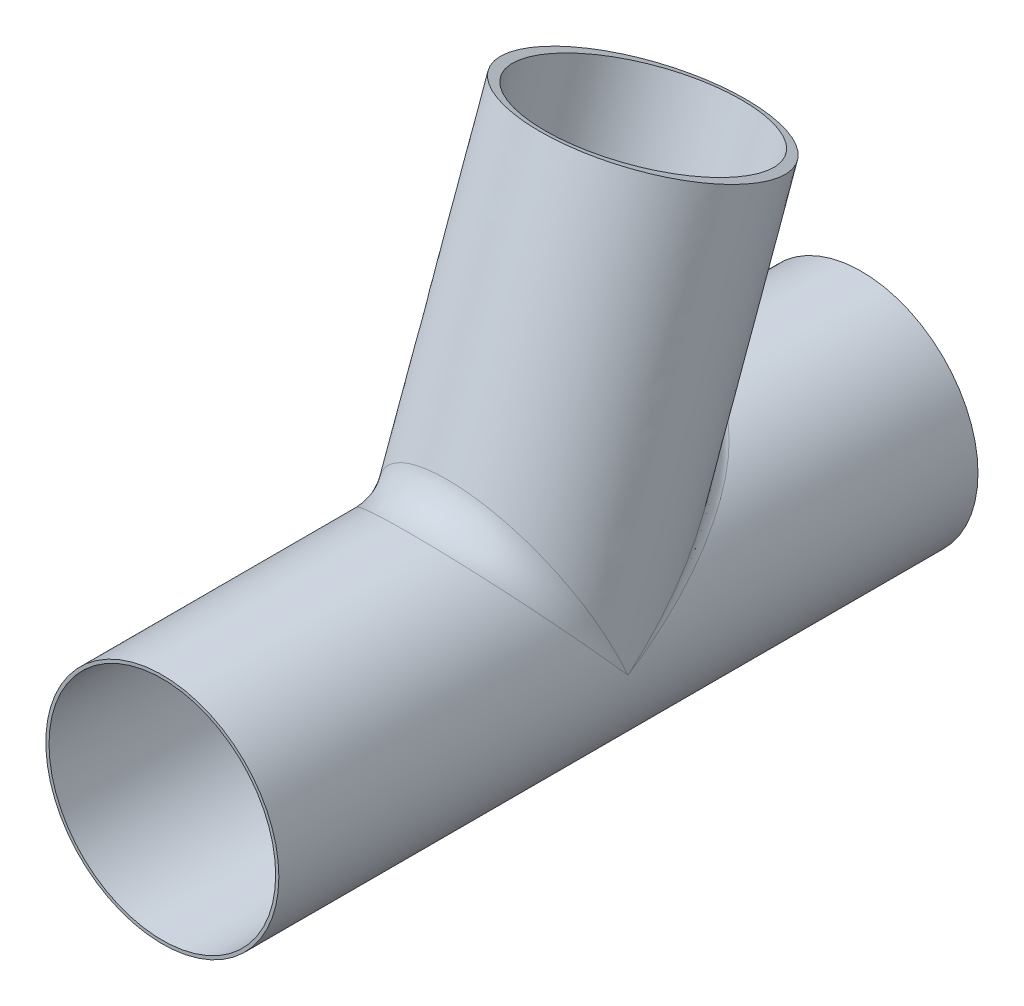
ISO-10303-21;
HEADER;
FILE_DESCRIPTION(('STEP AP214'),'2;1');
FILE_NAME('part.step','',(''),(''),'','','');
FILE_SCHEMA(('AUTOMOTIVE_DESIGN { 1 0 10303 214 1 1 1 1 }'));
ENDSEC;
DATA;
#1=APPLICATION_CONTEXT('core data for automotive mechanical design processes');
#2=APPLICATION_PROTOCOL_DEFINITION('international standard','automotive_design',2000,#1);
#3=PRODUCT_CONTEXT('',#1,'mechanical');
#4=PRODUCT('Part','Part','',(#3));
#5=PRODUCT_RELATED_PRODUCT_CATEGORY('part','',(#4));
#6=PRODUCT_DEFINITION_FORMATION('','',#4);
#7=PRODUCT_DEFINITION_CONTEXT('part definition',#1,'design');
#8=PRODUCT_DEFINITION('design','',#6,#7);
#9=PRODUCT_DEFINITION_SHAPE('','',#8);
#10=(LENGTH_UNIT() NAMED_UNIT(*) SI_UNIT(.MILLI.,.METRE.));
#11=(NAMED_UNIT(*) PLANE_ANGLE_UNIT() SI_UNIT($,.RADIAN.));
#12=(NAMED_UNIT(*) SI_UNIT($,.STERADIAN.) SOLID_ANGLE_UNIT());
#13=UNCERTAINTY_MEASURE_WITH_UNIT(LENGTH_MEASURE(1.E-05),#10,'distance_accuracy_value','');
#14=(GEOMETRIC_REPRESENTATION_CONTEXT(3) GLOBAL_UNCERTAINTY_ASSIGNED_CONTEXT((#13)) GLOBAL_UNIT_ASSIGNED_CONTEXT((#10,
#11,#12)) REPRESENTATION_CONTEXT('',''));
#15=CARTESIAN_POINT('',(0.,0.,0.));
#16=DIRECTION('',(0.,0.,1.));
#17=DIRECTION('',(1.,0.,0.));
#18=AXIS2_PLACEMENT_3D('',#15,#16,#17);
#19=CARTESIAN_POINT('',(0.,0.,0.));
#20=DIRECTION('',(0.,0.,1.));
#21=DIRECTION('',(1.,0.,0.));
#22=AXIS2_PLACEMENT_3D('',#19,#20,#21);
#23=PLANE('',#22);
#24=CARTESIAN_POINT('',(0.,0.,0.));
#25=DIRECTION('',(0.,0.,1.));
#26=DIRECTION('',(1.,0.,0.));
#27=AXIS2_PLACEMENT_3D('',#24,#25,#26);
#28=CIRCLE('',#27,49.403);
#29=CARTESIAN_POINT('',(49.403,0.,0.));
#30=VERTEX_POINT('',#29);
#31=EDGE_CURVE('E176',#30,#30,#28,.T.);
#32=ORIENTED_EDGE('',*,*,#31,.F.);
#33=EDGE_LOOP('',(#32));
#34=FACE_BOUND('',#33,.T.);
#35=CARTESIAN_POINT('',(0.,0.,0.));
#36=DIRECTION('',(0.,0.,1.));
#37=DIRECTION('',(1.,0.,0.));
#38=AXIS2_PLACEMENT_3D('',#35,#36,#37);
#39=CIRCLE('',#38,50.8);
#40=CARTESIAN_POINT('',(50.8,0.,0.));
#41=VERTEX_POINT('',#40);
#42=EDGE_CURVE('E67',#41,#41,#39,.T.);
#43=ORIENTED_EDGE('',*,*,#42,.T.);
#44=EDGE_LOOP('',(#43));
#45=FACE_BOUND('',#44,.T.);
#46=ADVANCED_FACE('F44',(#34,#45),#23,.T.);
#47=CARTESIAN_POINT('',(0.,0.,-304.8));
#48=DIRECTION('',(0.,0.,1.));
#49=DIRECTION('',(1.,0.,0.));
#50=AXIS2_PLACEMENT_3D('',#47,#48,#49);
#51=PLANE('',#50);
#52=CARTESIAN_POINT('',(0.,0.,-304.8));
#53=DIRECTION('',(0.,0.,1.));
#54=DIRECTION('',(1.,0.,0.));
#55=AXIS2_PLACEMENT_3D('',#52,#53,#54);
#56=CIRCLE('',#55,49.403);
#57=CARTESIAN_POINT('',(49.403,0.,-304.8));
#58=VERTEX_POINT('',#57);
#59=EDGE_CURVE('E168',#58,#58,#56,.T.);
#60=ORIENTED_EDGE('',*,*,#59,.T.);
#61=EDGE_LOOP('',(#60));
#62=FACE_BOUND('',#61,.T.);
#63=CARTESIAN_POINT('',(0.,0.,-304.8));
#64=DIRECTION('',(0.,0.,1.));
#65=DIRECTION('',(1.,0.,0.));
#66=AXIS2_PLACEMENT_3D('',#63,#64,#65);
#67=CIRCLE('',#66,50.8);
#68=CARTESIAN_POINT('',(50.8,0.,-304.8));
#69=VERTEX_POINT('',#68);
#70=EDGE_CURVE('E86',#69,#69,#67,.T.);
#71=ORIENTED_EDGE('',*,*,#70,.F.);
#72=EDGE_LOOP('',(#71));
#73=FACE_BOUND('',#72,.T.);
#74=ADVANCED_FACE('F158',(#62,#73),#51,.F.);
#75=CARTESIAN_POINT('',(0.,0.,0.));
#76=DIRECTION('',(0.,0.,-1.));
#77=DIRECTION('',(-1.,0.,0.));
#78=AXIS2_PLACEMENT_3D('',#75,#76,#77);
#79=CYLINDRICAL_SURFACE('',#78,50.8);
#80=CARTESIAN_POINT('',(50.8,0.,-152.199606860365));
#81=CARTESIAN_POINT('',(50.8,0.,-152.199606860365));
#82=CARTESIAN_POINT('',(50.8,0.,-152.199606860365));
#83=CARTESIAN_POINT('',(50.7999999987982,0.0102665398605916,-152.211796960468));
#84=CARTESIAN_POINT('',(50.8000000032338,0.00939632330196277,-152.212430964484));
#85=CARTESIAN_POINT('',(50.7999999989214,0.00852610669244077,-152.213064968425));
#86=CARTESIAN_POINT('',(50.7999978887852,0.0205330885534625,-152.223987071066));
#87=CARTESIAN_POINT('',(50.799997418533,0.0187926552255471,-152.225255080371));
#88=CARTESIAN_POINT('',(50.7999978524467,0.0170522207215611,-152.226523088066));
#89=CARTESIAN_POINT('',(50.7994222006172,1.42145506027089,-153.887388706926));
#90=CARTESIAN_POINT('',(50.7992915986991,1.30097940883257,-153.975183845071));
#91=CARTESIAN_POINT('',(50.7994121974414,1.18048317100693,-154.062950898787));
#92=CARTESIAN_POINT('',(50.7601569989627,2.8122623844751,-155.538782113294));
#93=CARTESIAN_POINT('',(50.7510821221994,2.57529393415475,-155.714368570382));
#94=CARTESIAN_POINT('',(50.7594659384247,2.33551448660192,-155.886120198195));
#95=CARTESIAN_POINT('',(50.6038996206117,5.59167617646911,-158.839332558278));
#96=CARTESIAN_POINT('',(50.5597320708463,5.1180458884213,-159.184704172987));
#97=CARTESIAN_POINT('',(50.6005298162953,4.64383080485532,-159.529693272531));
#98=CARTESIAN_POINT('',(50.4868938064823,6.9802822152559,-160.488489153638));
#99=CARTESIAN_POINT('',(50.4161523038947,6.38927665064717,-160.9196673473));
#100=CARTESIAN_POINT('',(50.481526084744,5.79711546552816,-161.350096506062));
#101=CARTESIAN_POINT('',(50.1740207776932,9.75398854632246,-163.783383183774));
#102=CARTESIAN_POINT('',(50.0333471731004,8.9235676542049,-164.37841694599));
#103=CARTESIAN_POINT('',(50.1634152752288,8.10093402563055,-164.98654315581));
#104=CARTESIAN_POINT('',(49.9780824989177,11.1390845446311,-165.429116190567));
#105=CARTESIAN_POINT('',(49.7931821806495,10.1893981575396,-166.105984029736));
#106=CARTESIAN_POINT('',(49.964236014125,9.25146450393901,-166.802581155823));
#107=CARTESIAN_POINT('',(49.5056948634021,13.9018114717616,-168.712811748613));
#108=CARTESIAN_POINT('',(49.2160786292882,12.7080490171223,-169.543323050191));
#109=CARTESIAN_POINT('',(49.4842535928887,11.5465622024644,-170.42521809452));
#110=CARTESIAN_POINT('',(49.2292502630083,15.2794428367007,-170.350774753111));
#111=CARTESIAN_POINT('',(48.8778398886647,13.9636215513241,-171.256850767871));
#112=CARTESIAN_POINT('',(49.2034552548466,12.6911297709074,-172.231817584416));
#113=CARTESIAN_POINT('',(48.5933114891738,18.0251201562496,-173.616736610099));
#114=CARTESIAN_POINT('',(48.1026421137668,16.4584574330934,-174.661594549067));
#115=CARTESIAN_POINT('',(48.5578738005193,14.9726107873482,-175.832900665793));
#116=CARTESIAN_POINT('',(48.2337788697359,19.3931613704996,-175.244730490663));
#117=CARTESIAN_POINT('',(47.6638492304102,17.7004063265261,-176.356475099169));
#118=CARTESIAN_POINT('',(48.1930518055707,16.1095204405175,-177.627378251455));
#119=CARTESIAN_POINT('',(47.4285271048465,22.115879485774,-178.486553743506));
#120=CARTESIAN_POINT('',(46.6852397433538,20.1629325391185,-179.717000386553));
#121=CARTESIAN_POINT('',(47.3765182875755,18.372609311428,-181.199354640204));
#122=CARTESIAN_POINT('',(46.9828018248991,23.4705554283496,-180.100382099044));
#123=CARTESIAN_POINT('',(46.1431020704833,21.3861195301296,-181.386205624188));
#124=CARTESIAN_POINT('',(46.9248005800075,19.4987877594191,-182.976852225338));
#125=CARTESIAN_POINT('',(46.0016003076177,26.1613937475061,-183.307992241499));
#126=CARTESIAN_POINT('',(44.9554965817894,23.8045048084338,-184.686332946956));
#127=CARTESIAN_POINT('',(45.931199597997,21.7361880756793,-186.508192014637));
#128=CARTESIAN_POINT('',(45.4662100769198,27.4975725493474,-184.901791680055));
#129=CARTESIAN_POINT('',(44.3072390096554,25.002215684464,-186.320682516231));
#130=CARTESIAN_POINT('',(45.389402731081,22.8474231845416,-188.262055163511));
#131=CARTESIAN_POINT('',(44.3004866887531,30.147993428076,-188.065456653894));
#132=CARTESIAN_POINT('',(42.9038096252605,27.3642117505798,-189.543659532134));
#133=CARTESIAN_POINT('',(44.2107790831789,25.0521323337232,-191.741694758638));
#134=CARTESIAN_POINT('',(43.6701733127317,31.4622400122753,-189.635327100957));
#135=CARTESIAN_POINT('',(42.1451535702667,28.5307704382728,-191.135387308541));
#136=CARTESIAN_POINT('',(43.5739721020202,26.1456100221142,-193.467476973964));
#137=CARTESIAN_POINT('',(42.3620817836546,33.9610713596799,-192.622497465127));
#138=CARTESIAN_POINT('',(40.5826583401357,30.7308287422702,-194.137156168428));
#139=CARTESIAN_POINT('',(42.2536864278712,28.225184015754,-196.749510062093));
#140=CARTESIAN_POINT('',(41.6919532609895,35.1477151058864,-194.042074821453));
#141=CARTESIAN_POINT('',(39.7825804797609,31.7707197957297,-195.555926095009));
#142=CARTESIAN_POINT('',(41.5778351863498,29.2129540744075,-198.308406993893));
#143=CARTESIAN_POINT('',(40.2602448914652,37.4925426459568,-196.849317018));
#144=CARTESIAN_POINT('',(38.0857620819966,33.808146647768,-198.33553464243));
#145=CARTESIAN_POINT('',(40.1352641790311,31.1652654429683,-201.389488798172));
#146=CARTESIAN_POINT('',(39.4986709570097,38.6507282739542,-198.236983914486));
#147=CARTESIAN_POINT('',(37.1852608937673,34.8068718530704,-199.697992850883));
#148=CARTESIAN_POINT('',(39.3685502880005,32.129808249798,-202.911676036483));
#149=CARTESIAN_POINT('',(37.8775388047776,40.9318975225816,-200.972315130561));
#150=CARTESIAN_POINT('',(35.2856773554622,36.7525785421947,-202.352142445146));
#151=CARTESIAN_POINT('',(37.7380866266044,34.030047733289,-205.91047342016));
#152=CARTESIAN_POINT('',(37.0179906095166,42.0548847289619,-202.319983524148));
#153=CARTESIAN_POINT('',(34.2823653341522,37.7002629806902,-203.644788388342));
#154=CARTESIAN_POINT('',(36.8743467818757,34.9657473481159,-207.387088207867));
#155=CARTESIAN_POINT('',(35.1934338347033,44.2571306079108,-204.964999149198));
#156=CARTESIAN_POINT('',(32.1768263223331,39.5323620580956,-206.143557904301));
#157=CARTESIAN_POINT('',(35.042747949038,36.8011773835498,-210.283501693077));
#158=CARTESIAN_POINT('',(34.2284413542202,45.336395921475,-206.262354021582));
#159=CARTESIAN_POINT('',(31.0700176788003,40.416786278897,-207.349688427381));
#160=CARTESIAN_POINT('',(34.0749048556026,37.7009132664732,-211.703309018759));
#161=CARTESIAN_POINT('',(32.3507649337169,47.2692741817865,-208.587713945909));
#162=CARTESIAN_POINT('',(28.9529013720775,41.9674111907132,-209.464092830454));
#163=CARTESIAN_POINT('',(32.1935989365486,39.3126798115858,-214.246672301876));
#164=CARTESIAN_POINT('',(31.4550666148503,48.1310544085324,-209.625227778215));
#165=CARTESIAN_POINT('',(27.949016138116,42.648131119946,-210.392202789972));
#166=CARTESIAN_POINT('',(31.2968603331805,40.031452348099,-215.380874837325));
#167=CARTESIAN_POINT('',(30.0479291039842,49.3886490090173,-211.140293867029));
#168=CARTESIAN_POINT('',(26.405898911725,43.6149942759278,-211.710268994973));
#169=CARTESIAN_POINT('',(29.8892648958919,41.0805775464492,-217.036338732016));
#170=CARTESIAN_POINT('',(29.5682522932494,49.8020265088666,-211.638478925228));
#171=CARTESIAN_POINT('',(25.8798055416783,43.9311830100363,-212.141277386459));
#172=CARTESIAN_POINT('',(29.40961923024,41.4254680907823,-217.58055330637));
#173=CARTESIAN_POINT('',(28.5870823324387,50.6158803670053,-212.619629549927));
#174=CARTESIAN_POINT('',(24.8122796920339,44.5464045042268,-212.979840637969));
#175=CARTESIAN_POINT('',(28.4289058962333,42.1045565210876,-218.652101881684));
#176=CARTESIAN_POINT('',(28.085580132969,51.0163512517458,-213.102588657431));
#177=CARTESIAN_POINT('',(24.2705740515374,44.8452298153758,-213.38711176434));
#178=CARTESIAN_POINT('',(27.9278293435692,42.4387498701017,-219.179428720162));
#179=CARTESIAN_POINT('',(25.5302858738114,52.9765430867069,-215.467334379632));
#180=CARTESIAN_POINT('',(21.4793530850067,46.3167428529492,-215.392450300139));
#181=CARTESIAN_POINT('',(25.3757277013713,44.0747044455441,-221.760796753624));
#182=CARTESIAN_POINT('',(23.304065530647,54.434611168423,-217.228905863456));
#183=CARTESIAN_POINT('',(19.1689590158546,47.3096770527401,-216.744914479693));
#184=CARTESIAN_POINT('',(23.1554715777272,45.2921504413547,-223.681736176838));
#185=CARTESIAN_POINT('',(19.8965487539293,56.2532711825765,-219.428424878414));
#186=CARTESIAN_POINT('',(15.9050321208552,48.4373260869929,-218.279906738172));
#187=CARTESIAN_POINT('',(19.7620360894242,46.8111777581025,-226.078465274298));
#188=CARTESIAN_POINT('',(18.8678053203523,56.7561317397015,-220.036908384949));
#189=CARTESIAN_POINT('',(14.9288637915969,48.7384372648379,-218.68963119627));
#190=CARTESIAN_POINT('',(18.7380977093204,47.2312579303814,-226.741261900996));
#191=CARTESIAN_POINT('',(16.7463010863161,57.6940710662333,-221.172308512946));
#192=CARTESIAN_POINT('',(12.975137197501,49.2761426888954,-219.421009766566));
#193=CARTESIAN_POINT('',(16.6275752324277,48.0148925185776,-227.977658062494));
#194=CARTESIAN_POINT('',(15.6534942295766,58.1291002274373,-221.699165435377));
#195=CARTESIAN_POINT('',(11.9996535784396,49.5105958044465,-219.739743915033));
#196=CARTESIAN_POINT('',(15.5409460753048,48.3784055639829,-228.551192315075));
#197=CARTESIAN_POINT('',(13.7270003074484,58.8077158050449,-222.52130045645));
#198=CARTESIAN_POINT('',(10.3416343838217,49.8574077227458,-220.210994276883));
#199=CARTESIAN_POINT('',(13.626173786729,48.9455203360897,-229.445953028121));
#200=CARTESIAN_POINT('',(12.9073360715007,59.0706650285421,-222.839951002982));
#201=CARTESIAN_POINT('',(9.65220415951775,49.985385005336,-220.384806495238));
#202=CARTESIAN_POINT('',(12.8117394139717,49.1652849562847,-229.792682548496));
#203=CARTESIAN_POINT('',(11.2407594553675,59.5514835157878,-223.422741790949));
#204=CARTESIAN_POINT('',(8.28478157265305,50.210404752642,-220.690287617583));
#205=CARTESIAN_POINT('',(11.1562310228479,49.5671635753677,-230.426735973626));
#206=CARTESIAN_POINT('',(10.3938441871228,59.7693479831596,-223.686876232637));
#207=CARTESIAN_POINT('',(7.60842008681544,50.3067786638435,-220.821046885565));
#208=CARTESIAN_POINT('',(10.3151541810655,49.7492735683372,-230.714053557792));
#209=CARTESIAN_POINT('',(8.6770910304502,60.1559522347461,-224.155662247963));
#210=CARTESIAN_POINT('',(6.26951155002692,50.4714798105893,-221.04441108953));
#211=CARTESIAN_POINT('',(8.61059762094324,50.0724471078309,-231.22392722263));
#212=CARTESIAN_POINT('',(7.80725588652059,60.3246978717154,-224.360320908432));
#213=CARTESIAN_POINT('',(5.60888074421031,50.5392720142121,-221.136289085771));
#214=CARTESIAN_POINT('',(7.74712058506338,50.2135155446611,-231.446491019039));
#215=CARTESIAN_POINT('',(6.0498588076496,60.6096801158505,-224.705992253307));
#216=CARTESIAN_POINT('',(4.30050530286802,50.650301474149,-221.286703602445));
#217=CARTESIAN_POINT('',(6.00284249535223,50.4517640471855,-231.822374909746));
#218=CARTESIAN_POINT('',(5.16229770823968,60.7259191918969,-224.847007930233));
#219=CARTESIAN_POINT('',(3.65487802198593,50.6931546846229,-221.344719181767));
#220=CARTESIAN_POINT('',(5.12204225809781,50.5489461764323,-231.975698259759));
#221=CARTESIAN_POINT('',(3.37156930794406,60.9037433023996,-225.062748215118));
#222=CARTESIAN_POINT('',(2.36943136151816,50.7575855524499,-221.431922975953));
#223=CARTESIAN_POINT('',(3.34512771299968,50.6976194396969,-232.210258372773));
#224=CARTESIAN_POINT('',(2.46834838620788,60.9650698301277,-225.137159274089));
#225=CARTESIAN_POINT('',(1.73192733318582,50.7788302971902,-221.460660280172));
#226=CARTESIAN_POINT('',(2.44896100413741,50.748894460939,-232.291154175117));
#227=CARTESIAN_POINT('',(0.657578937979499,61.0306903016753,-225.216780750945));
#228=CARTESIAN_POINT('',(0.459086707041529,50.801608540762,-221.491471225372));
#229=CARTESIAN_POINT('',(0.652398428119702,50.8037597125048,-232.377714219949));
#230=CARTESIAN_POINT('',(-0.249969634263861,61.0349836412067,-225.221990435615));
#231=CARTESIAN_POINT('',(-0.173940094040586,50.8030594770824,-221.493433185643));
#232=CARTESIAN_POINT('',(-0.247997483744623,50.8073494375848,-232.383377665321));
#233=CARTESIAN_POINT('',(-2.0618121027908,60.9864356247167,-225.163083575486));
#234=CARTESIAN_POINT('',(-1.44560290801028,50.7862598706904,-221.470710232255));
#235=CARTESIAN_POINT('',(-2.0456079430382,50.7667583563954,-232.319337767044));
#236=CARTESIAN_POINT('',(-2.96610618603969,60.9335976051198,-225.098971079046));
#237=CARTESIAN_POINT('',(-2.08192629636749,50.7680712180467,-221.4461090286));
#238=CARTESIAN_POINT('',(-2.94282267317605,50.7225803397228,-232.249638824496));
#239=CARTESIAN_POINT('',(-4.76420891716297,60.772040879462,-224.902962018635));
#240=CARTESIAN_POINT('',(-3.36715920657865,50.7100408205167,-221.367577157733));
#241=CARTESIAN_POINT('',(-4.72700536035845,50.5875067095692,-232.036534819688));
#242=CARTESIAN_POINT('',(-5.65801771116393,60.6633229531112,-224.771066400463));
#243=CARTESIAN_POINT('',(-4.01379545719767,50.670408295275,-221.31392975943));
#244=CARTESIAN_POINT('',(-5.61397346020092,50.4966117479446,-231.893130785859));
#245=CARTESIAN_POINT('',(-7.37793725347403,60.4002132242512,-224.451913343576));
#246=CARTESIAN_POINT('',(-5.28678755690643,50.5690900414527,-221.17669191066));
#247=CARTESIAN_POINT('',(-7.32097897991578,50.2766462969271,-231.546092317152));
#248=CARTESIAN_POINT('',(-8.20499755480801,60.2487869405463,-224.268250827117));
#249=CARTESIAN_POINT('',(-5.91003244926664,50.5091331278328,-221.09544765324));
#250=CARTESIAN_POINT('',(-8.14194444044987,50.1500545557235,-231.346368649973));
#251=CARTESIAN_POINT('',(-9.83927809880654,59.9012645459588,-223.846824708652));
#252=CARTESIAN_POINT('',(-7.17224371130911,50.3638007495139,-220.89839319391));
#253=CARTESIAN_POINT('',(-9.76448324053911,49.8595442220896,-230.888028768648));
#254=CARTESIAN_POINT('',(-10.6464996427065,59.7051713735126,-223.609064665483));
#255=CARTESIAN_POINT('',(-7.80953960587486,50.2788595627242,-220.783172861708));
#256=CARTESIAN_POINT('',(-10.5660578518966,49.6956280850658,-230.629416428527));
#257=CARTESIAN_POINT('',(-12.2376786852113,59.271521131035,-223.083387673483));
#258=CARTESIAN_POINT('',(-9.098378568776,50.0806332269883,-220.514132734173));
#259=CARTESIAN_POINT('',(-12.1464694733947,49.3331611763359,-230.057545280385));
#260=CARTESIAN_POINT('',(-13.0216300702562,59.0339532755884,-222.795457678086));
#261=CARTESIAN_POINT('',(-9.74847378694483,49.9678821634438,-220.361039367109));
#262=CARTESIAN_POINT('',(-12.9253005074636,49.134601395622,-229.744272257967));
#263=CARTESIAN_POINT('',(-14.5634587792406,58.520868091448,-222.173763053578));
#264=CARTESIAN_POINT('',(-11.0591324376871,49.7119520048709,-220.01337087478));
#265=CARTESIAN_POINT('',(-14.4574717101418,48.7057981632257,-229.067733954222));
#266=CARTESIAN_POINT('',(-15.3213299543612,58.2453418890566,-221.839987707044));
#267=CARTESIAN_POINT('',(-11.7185183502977,49.5693846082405,-219.819628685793));
#268=CARTESIAN_POINT('',(-15.2108058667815,48.4755473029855,-228.704456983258));
#269=CARTESIAN_POINT('',(-17.1700933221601,57.5177942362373,-220.958881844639));
#270=CARTESIAN_POINT('',(-13.3585887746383,49.177161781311,-219.286405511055));
#271=CARTESIAN_POINT('',(-17.0490626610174,47.8676073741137,-227.74527678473));
#272=CARTESIAN_POINT('',(-18.2441708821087,57.0449966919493,-220.386505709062));
#273=CARTESIAN_POINT('',(-14.3463750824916,48.9087990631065,-218.921405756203));
#274=CARTESIAN_POINT('',(-18.1175435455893,47.4725827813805,-227.1220193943));
#275=CARTESIAN_POINT('',(-20.3274950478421,56.0345480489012,-219.16384186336));
#276=CARTESIAN_POINT('',(-16.3183010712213,48.3018032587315,-218.095457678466));
#277=CARTESIAN_POINT('',(-20.1910757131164,46.6284782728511,-225.79020250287));
#278=CARTESIAN_POINT('',(-21.3367145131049,55.4968700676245,-218.513521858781));
#279=CARTESIAN_POINT('',(-17.3009546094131,47.9652475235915,-217.637343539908));
#280=CARTESIAN_POINT('',(-21.1961004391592,46.1793759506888,-225.081607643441));
#281=CARTESIAN_POINT('',(-23.2916030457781,54.3655969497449,-217.145977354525));
#282=CARTESIAN_POINT('',(-19.2482781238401,47.2252069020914,-216.629684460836));
#283=CARTESIAN_POINT('',(-23.1439578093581,45.2346231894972,-223.590955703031));
#284=CARTESIAN_POINT('',(-24.2371450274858,53.7718953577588,-216.428625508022));
#285=CARTESIAN_POINT('',(-20.2126296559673,46.823438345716,-216.082482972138));
#286=CARTESIAN_POINT('',(-24.0866660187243,44.7388841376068,-222.808758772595));
#287=CARTESIAN_POINT('',(-26.0637234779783,52.5381378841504,-214.93874916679));
#288=CARTESIAN_POINT('',(-22.108865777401,45.9596415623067,-214.905728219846));
#289=CARTESIAN_POINT('',(-25.9088617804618,43.7088812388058,-221.18355779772));
#290=CARTESIAN_POINT('',(-26.9447599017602,51.8980819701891,-214.16622463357));
#291=CARTESIAN_POINT('',(-23.0412919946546,45.4991066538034,-214.278215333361));
#292=CARTESIAN_POINT('',(-26.7883492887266,43.1746173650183,-220.34055371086));
#293=CARTESIAN_POINT('',(-29.1138012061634,50.2148197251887,-212.135770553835));
#294=CARTESIAN_POINT('',(-25.353783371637,44.2632065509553,-212.593912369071));
#295=CARTESIAN_POINT('',(-28.9549315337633,41.7698301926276,-218.123938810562));
#296=CARTESIAN_POINT('',(-30.3582352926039,49.1439743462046,-210.845134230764));
#297=CARTESIAN_POINT('',(-26.7230701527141,43.445543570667,-211.479337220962));
#298=CARTESIAN_POINT('',(-30.1992790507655,40.8763774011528,-216.714131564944));
#299=CARTESIAN_POINT('',(-32.7083290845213,46.9293678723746,-208.178482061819));
#300=CARTESIAN_POINT('',(-29.341967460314,41.7052236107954,-209.106625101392));
#301=CARTESIAN_POINT('',(-32.5515174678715,39.029176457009,-213.799312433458));
#302=CARTESIAN_POINT('',(-33.8139104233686,45.7855661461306,-206.802418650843));
#303=CARTESIAN_POINT('',(-30.5972557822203,40.7845652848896,-207.851226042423));
#304=CARTESIAN_POINT('',(-33.6593313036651,38.0753947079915,-212.294247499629));
#305=CARTESIAN_POINT('',(-35.8986830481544,43.4390925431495,-203.982092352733));
#306=CARTESIAN_POINT('',(-32.9828334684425,38.8592340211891,-205.225534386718));
#307=CARTESIAN_POINT('',(-35.7503650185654,36.1193090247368,-209.207484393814));
#308=CARTESIAN_POINT('',(-36.8776271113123,42.2363116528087,-202.537703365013));
#309=CARTESIAN_POINT('',(-34.1189362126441,37.8548637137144,-203.855663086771));
#310=CARTESIAN_POINT('',(-36.7333411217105,35.1169152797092,-207.625644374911));
#311=CARTESIAN_POINT('',(-38.7166006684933,39.7861536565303,-199.598032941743));
#312=CARTESIAN_POINT('',(-36.2631773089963,35.7818100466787,-201.027948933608));
#313=CARTESIAN_POINT('',(-38.581660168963,33.0755372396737,-204.404156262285));
#314=CARTESIAN_POINT('',(-39.576640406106,38.5387804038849,-198.102755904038));
#315=CARTESIAN_POINT('',(-37.2769559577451,34.7125275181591,-199.569295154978));
#316=CARTESIAN_POINT('',(-39.4470132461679,32.036556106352,-202.764513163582));
#317=CARTESIAN_POINT('',(-41.0375268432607,36.2430419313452,-195.353126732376));
#318=CARTESIAN_POINT('',(-39.007287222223,32.7225096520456,-196.854448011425));
#319=CARTESIAN_POINT('',(-40.9182684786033,30.1248663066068,-199.747567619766));
#320=CARTESIAN_POINT('',(-41.6568741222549,35.2006193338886,-194.10545996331));
#321=CARTESIAN_POINT('',(-39.7441205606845,31.8136030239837,-195.614426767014));
#322=CARTESIAN_POINT('',(-41.5425366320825,29.2570126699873,-198.377937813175));
#323=CARTESIAN_POINT('',(-42.8267791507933,33.0960151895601,-191.58814087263));
#324=CARTESIAN_POINT('',(-41.1383321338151,29.9683893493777,-193.096895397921));
#325=CARTESIAN_POINT('',(-42.7225776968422,27.5052151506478,-195.613244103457));
#326=CARTESIAN_POINT('',(-43.3773281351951,32.033831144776,-190.31848577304));
#327=CARTESIAN_POINT('',(-41.7980979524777,29.0311029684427,-191.818050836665));
#328=CARTESIAN_POINT('',(-43.2783418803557,26.6212692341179,-194.21817698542));
#329=CARTESIAN_POINT('',(-44.4134238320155,29.8925310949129,-187.760513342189));
#330=CARTESIAN_POINT('',(-43.0409711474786,27.1337716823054,-189.229221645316));
#331=CARTESIAN_POINT('',(-44.3249462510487,24.839627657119,-191.406304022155));
#332=CARTESIAN_POINT('',(-44.8989322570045,28.8134055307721,-186.472185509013));
#333=CARTESIAN_POINT('',(-43.6261348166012,26.1725614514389,-187.917648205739));
#334=CARTESIAN_POINT('',(-44.8157481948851,23.9419242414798,-189.989485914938));
#335=CARTESIAN_POINT('',(-45.8076377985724,26.6416294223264,-183.880849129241));
#336=CARTESIAN_POINT('',(-44.7218850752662,24.2321584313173,-185.269891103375));
#337=CARTESIAN_POINT('',(-45.734918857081,22.1355832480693,-187.138556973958));
#338=CARTESIAN_POINT('',(-46.230837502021,25.5489794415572,-182.577841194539));
#339=CARTESIAN_POINT('',(-45.2342794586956,23.2517035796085,-183.931986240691));
#340=CARTESIAN_POINT('',(-46.1632901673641,21.2269461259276,-185.704446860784));
#341=CARTESIAN_POINT('',(-47.0174303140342,23.3528497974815,-179.960244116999));
#342=CARTESIAN_POINT('',(-46.1867263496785,21.2766649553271,-181.236836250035));
#343=CARTESIAN_POINT('',(-46.9599277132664,19.4009542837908,-182.822435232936));
#344=CARTESIAN_POINT('',(-47.3808442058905,22.249374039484,-178.645659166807));
#345=CARTESIAN_POINT('',(-46.6283335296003,20.2807432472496,-179.877766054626));
#346=CARTESIAN_POINT('',(-47.3282148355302,18.4836027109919,-181.374538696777));
#347=CARTESIAN_POINT('',(-48.0502445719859,20.0332248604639,-176.006714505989));
#348=CARTESIAN_POINT('',(-47.4415592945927,18.2774402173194,-177.143938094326));
#349=CARTESIAN_POINT('',(-48.0069126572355,16.6415089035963,-178.467052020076));
#350=CARTESIAN_POINT('',(-48.3562295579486,18.9205512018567,-174.682354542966));
#351=CARTESIAN_POINT('',(-47.8144549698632,17.2686519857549,-175.76726084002));
#352=CARTESIAN_POINT('',(-48.3173218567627,15.7167664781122,-177.007461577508));
#353=CARTESIAN_POINT('',(-48.9124301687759,16.6883671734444,-172.026514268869));
#354=CARTESIAN_POINT('',(-48.4919316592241,15.2427494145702,-173.002504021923));
#355=CARTESIAN_POINT('',(-48.8817895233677,13.8618194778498,-174.079634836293));
#356=CARTESIAN_POINT('',(-49.1626724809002,15.5688603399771,-170.69503767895));
#357=CARTESIAN_POINT('',(-48.7975873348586,14.2241965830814,-171.612461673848));
#358=CARTESIAN_POINT('',(-49.135874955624,12.9316177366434,-172.611403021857));
#359=CARTESIAN_POINT('',(-49.6090062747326,13.3241625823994,-168.026162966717));
#360=CARTESIAN_POINT('',(-49.342348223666,12.1806687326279,-168.823581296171));
#361=CARTESIAN_POINT('',(-49.5892082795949,11.0666726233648,-169.667750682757));
#362=CARTESIAN_POINT('',(-49.8051015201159,12.198972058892,-166.68876526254));
#363=CARTESIAN_POINT('',(-49.5822824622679,11.1542197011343,-167.422731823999));
#364=CARTESIAN_POINT('',(-49.7884599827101,10.1319295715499,-168.192330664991));
#365=CARTESIAN_POINT('',(-50.1126173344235,10.1547411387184,-164.259589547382));
#366=CARTESIAN_POINT('',(-49.9583625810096,9.28809430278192,-164.875910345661));
#367=CARTESIAN_POINT('',(-50.1010001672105,8.43382863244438,-165.511994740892));
#368=CARTESIAN_POINT('',(-50.2330108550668,9.23642307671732,-163.168559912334));
#369=CARTESIAN_POINT('',(-50.1057582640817,8.44910307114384,-163.730877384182));
#370=CARTESIAN_POINT('',(-50.2233921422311,7.67104700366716,-164.307991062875));
#371=CARTESIAN_POINT('',(-50.4391535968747,7.39781667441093,-160.984485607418));
#372=CARTESIAN_POINT('',(-50.3579871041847,6.76917098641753,-161.438139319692));
#373=CARTESIAN_POINT('',(-50.4329874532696,6.14391759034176,-161.89750380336));
#374=CARTESIAN_POINT('',(-50.5249059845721,6.47752852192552,-159.891441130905));
#375=CARTESIAN_POINT('',(-50.4630708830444,5.92742073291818,-160.289329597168));
#376=CARTESIAN_POINT('',(-50.5201940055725,5.37956995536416,-160.691020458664));
#377=CARTESIAN_POINT('',(-50.7305799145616,3.71647740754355,-156.612414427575));
#378=CARTESIAN_POINT('',(-50.714581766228,3.40472432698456,-156.846375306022));
#379=CARTESIAN_POINT('',(-50.729371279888,3.08644299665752,-157.071429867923));
#380=CARTESIAN_POINT('',(-50.7992366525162,1.8733962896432,-154.42400654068));
#381=CARTESIAN_POINT('',(-50.7990632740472,1.71462077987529,-154.539721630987));
#382=CARTESIAN_POINT('',(-50.7992234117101,1.55580913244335,-154.655387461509));
#383=CARTESIAN_POINT('',(-50.7999978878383,0.0205330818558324,-152.223987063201));
#384=CARTESIAN_POINT('',(-50.7999974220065,0.0187926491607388,-152.225255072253));
#385=CARTESIAN_POINT('',(-50.7999978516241,0.0170522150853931,-152.226523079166));
#386=CARTESIAN_POINT('',(-50.7999999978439,0.0102665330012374,-152.211796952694));
#387=CARTESIAN_POINT('',(-50.8000000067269,0.0093963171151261,-152.212430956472));
#388=CARTESIAN_POINT('',(-50.7999999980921,0.00852610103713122,-152.213064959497));
#389=CARTESIAN_POINT('',(-50.8,-1.94068504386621E-10,-152.199606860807));
#390=CARTESIAN_POINT('',(-50.8,-1.94068504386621E-10,-152.199606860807));
#391=CARTESIAN_POINT('',(-50.8,0.,-152.199606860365));
#392=(BOUNDED_SURFACE() B_SPLINE_SURFACE(3,2,((#80,#81,#82),(#83,#84,#85),(#86,#87,#88),(#89,
#90,#91),(#92,#93,#94),(#95,#96,#97),(#98,#99,#100),(#101,#102,#103),(#104,#105,#106),(#107,
#108,#109),(#110,#111,#112),(#113,#114,#115),(#116,#117,#118),(#119,#120,#121),(#122,#123,#124),
(#125,#126,#127),(#128,#129,#130),(#131,#132,#133),(#134,#135,#136),(#137,#138,#139),(#140,#141,
#142),(#143,#144,#145),(#146,#147,#148),(#149,#150,#151),(#152,#153,#154),(#155,#156,#157),
(#158,#159,#160),(#161,#162,#163),(#164,#165,#166),(#167,#168,#169),(#170,#171,#172),(#173,#174,
#175),(#176,#177,#178),(#179,#180,#181),(#182,#183,#184),(#185,#186,#187),(#188,#189,#190),
(#191,#192,#193),(#194,#195,#196),(#197,#198,#199),(#200,#201,#202),(#203,#204,#205),(#206,#207,
#208),(#209,#210,#211),(#212,#213,#214),(#215,#216,#217),(#218,#219,#220),(#221,#222,#223),
(#224,#225,#226),(#227,#228,#229),(#230,#231,#232),(#233,#234,#235),(#236,#237,#238),(#239,#240,
#241),(#242,#243,#244),(#245,#246,#247),(#248,#249,#250),(#251,#252,#253),(#254,#255,#256),
(#257,#258,#259),(#260,#261,#262),(#263,#264,#265),(#266,#267,#268),(#269,#270,#271),(#272,#273,
#274),(#275,#276,#277),(#278,#279,#280),(#281,#282,#283),(#284,#285,#286),(#287,#288,#289),
(#290,#291,#292),(#293,#294,#295),(#296,#297,#298),(#299,#300,#301),(#302,#303,#304),(#305,#306,
#307),(#308,#309,#310),(#311,#312,#313),(#314,#315,#316),(#317,#318,#319),(#320,#321,#322),
(#323,#324,#325),(#326,#327,#328),(#329,#330,#331),(#332,#333,#334),(#335,#336,#337),(#338,#339,
#340),(#341,#342,#343),(#344,#345,#346),(#347,#348,#349),(#350,#351,#352),(#353,#354,#355),
(#356,#357,#358),(#359,#360,#361),(#362,#363,#364),(#365,#366,#367),(#368,#369,#370),(#371,#372,
#373),(#374,#375,#376),(#377,#378,#379),(#380,#381,#382),(#383,#384,#385),(#386,#387,#388),
(#389,#390,#391)),.UNSPECIFIED.,.F.,.F.,.F.) B_SPLINE_SURFACE_WITH_KNOTS((4,2,2,2,2,2,2,2,2,2,2,
2,2,2,2,2,2,2,2,2,2,2,2,2,2,2,2,2,2,2,2,2,2,2,2,2,2,2,2,2,2,2,2,2,2,2,2,2,2,2,2,4),(3,3),(0.,
0.049953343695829,6.81637835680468,13.5839906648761,20.3577096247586,27.1310284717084,
33.9074877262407,40.6844294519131,47.4549075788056,54.2239767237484,60.4598501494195,
66.6953206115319,72.9301537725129,79.1640363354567,84.3848193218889,86.9955439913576,
89.6073616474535,100.002132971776,104.302889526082,108.606776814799,111.694679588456,
114.782910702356,117.870773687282,120.958491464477,124.060669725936,127.162880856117,
130.264910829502,133.366897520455,136.291596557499,139.21610324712,142.14137158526,
145.067324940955,149.412799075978,153.760079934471,158.115794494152,162.471512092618,
169.229752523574,175.991790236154,182.766835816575,189.541297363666,195.060737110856,
200.580879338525,206.104256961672,211.62740520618,217.148629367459,222.66999659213,
228.188714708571,233.707049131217,238.195370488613,242.683281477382,251.648682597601,
251.698635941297),(0.,1.),
.UNSPECIFIED.) GEOMETRIC_REPRESENTATION_ITEM() RATIONAL_B_SPLINE_SURFACE(((1.,1.,1.),(1.,
1.00000000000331,1.),(1.,0.99999997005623,1.),(1.,0.999991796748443,1.),(1.,0.999434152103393,
1.),(1.,0.997219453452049,1.),(1.,0.99556220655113,1.),(1.,0.991145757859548,1.),(1.,
0.988385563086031,1.),(1.,0.981763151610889,1.),(1.,0.977901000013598,1.),(1.,0.96907298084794,
1.),(1.,0.964106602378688,1.),(1.,0.953072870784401,1.),(1.,0.947005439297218,1.),(1.,
0.933781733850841,1.),(1.,0.926626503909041,1.),(1.,0.911236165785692,1.),(1.,0.903001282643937,
1.),(1.,0.886164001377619,1.),(1.,0.877641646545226,1.),(1.,0.859731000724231,1.),(1.,
0.850342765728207,1.),(1.,0.830754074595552,1.),(1.,0.820553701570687,1.),(1.,0.799428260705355,
1.),(1.,0.788503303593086,1.),(1.,0.767894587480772,1.),(1.,0.758297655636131,1.),(1.,
0.743694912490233,1.),(1.,0.738792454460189,1.),(1.,0.728942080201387,1.),(1.,0.72399414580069,
1.),(1.,0.699269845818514,1.),(1.,0.67924291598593,1.),(1.,0.652514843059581,1.),(1.,
0.644884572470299,1.),(1.,0.630279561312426,1.),(1.,0.623305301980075,1.),(1.,0.612180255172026,
1.),(1.,0.607788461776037,1.),(1.,0.599645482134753,1.),(1.,0.595894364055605,1.),(1.,
0.589163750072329,1.),(1.,0.586184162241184,1.),(1.,0.581112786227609,1.),(1.,0.57902095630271,
1.),(1.,0.575807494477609,1.),(1.,0.574690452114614,1.),(1.,0.573494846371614,1.),(1.,
0.573416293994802,1.),(1.,0.574301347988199,1.),(1.,0.575264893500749,1.),(1.,0.578189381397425,
1.),(1.,0.580150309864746,1.),(1.,0.584844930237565,1.),(1.,0.587528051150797,1.),(1.,
0.593607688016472,1.),(1.,0.597004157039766,1.),(1.,0.604403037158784,1.),(1.,0.608405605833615,
1.),(1.,0.61690500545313,1.),(1.,0.621401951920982,1.),(1.,0.63305831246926,1.),(1.,
0.640450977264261,1.),(1.,0.655773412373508,1.),(1.,0.663703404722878,1.),(1.,0.679858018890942,
1.),(1.,0.688083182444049,1.),(1.,0.704612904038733,1.),(1.,0.712917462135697,1.),(1.,
0.734016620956,1.),(1.,0.746761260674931,1.),(1.,0.771693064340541,1.),(1.,0.783879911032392,
1.),(1.,0.807486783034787,1.),(1.,0.818905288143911,1.),(1.,0.840811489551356,1.),(1.,
0.851299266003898,1.),(1.,0.869415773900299,1.),(1.,0.877214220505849,1.),(1.,0.892117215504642,
1.),(1.,0.899221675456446,1.),(1.,0.912722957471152,1.),(1.,0.919119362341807,1.),(1.,
0.93118979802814,1.),(1.,0.936863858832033,1.),(1.,0.947482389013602,1.),(1.,0.952427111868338,
1.),(1.,0.96158641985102,1.),(1.,0.965800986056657,1.),(1.,0.973496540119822,1.),(1.,
0.976977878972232,1.),(1.,0.983208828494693,1.),(1.,0.98595849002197,1.),(1.,0.990281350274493,
1.),(1.,0.991978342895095,1.),(1.,0.994888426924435,1.),(1.,0.996101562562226,1.),(1.,
0.999013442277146,1.),(1.,0.999989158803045,1.),(1.,0.999999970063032,1.),(1.,1.00000000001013,
1.),(1.,1.,1.))) REPRESENTATION_ITEM('') SURFACE());
#393=CARTESIAN_POINT('',(50.8,0.,-152.199606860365));
#394=CARTESIAN_POINT('',(50.7999999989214,0.00852610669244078,-152.213064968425));
#395=CARTESIAN_POINT('',(50.7999978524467,0.0170522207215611,-152.226523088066));
#396=CARTESIAN_POINT('',(50.7994121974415,1.18048317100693,-154.062950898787));
#397=CARTESIAN_POINT('',(50.7594659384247,2.33551448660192,-155.886120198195));
#398=CARTESIAN_POINT('',(50.6005298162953,4.64383080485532,-159.529693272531));
#399=CARTESIAN_POINT('',(50.481526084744,5.79711546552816,-161.350096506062));
#400=CARTESIAN_POINT('',(50.1634152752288,8.10093402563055,-164.98654315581));
#401=CARTESIAN_POINT('',(49.964236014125,9.25146450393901,-166.802581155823));
#402=CARTESIAN_POINT('',(49.4842535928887,11.5465622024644,-170.42521809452));
#403=CARTESIAN_POINT('',(49.2034552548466,12.6911297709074,-172.231817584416));
#404=CARTESIAN_POINT('',(48.5578738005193,14.9726107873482,-175.832900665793));
#405=CARTESIAN_POINT('',(48.1930518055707,16.1095204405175,-177.627378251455));
#406=CARTESIAN_POINT('',(47.3765182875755,18.372609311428,-181.199354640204));
#407=CARTESIAN_POINT('',(46.9248005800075,19.4987877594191,-182.976852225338));
#408=CARTESIAN_POINT('',(45.931199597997,21.7361880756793,-186.508192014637));
#409=CARTESIAN_POINT('',(45.389402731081,22.8474231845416,-188.262055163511));
#410=CARTESIAN_POINT('',(44.2107790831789,25.0521323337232,-191.741694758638));
#411=CARTESIAN_POINT('',(43.5739721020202,26.1456100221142,-193.467476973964));
#412=CARTESIAN_POINT('',(42.2536864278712,28.225184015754,-196.749510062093));
#413=CARTESIAN_POINT('',(41.5778351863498,29.2129540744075,-198.308406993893));
#414=CARTESIAN_POINT('',(40.1352641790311,31.1652654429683,-201.389488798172));
#415=CARTESIAN_POINT('',(39.3685502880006,32.129808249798,-202.911676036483));
#416=CARTESIAN_POINT('',(37.7380866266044,34.030047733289,-205.91047342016));
#417=CARTESIAN_POINT('',(36.8743467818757,34.9657473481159,-207.387088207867));
#418=CARTESIAN_POINT('',(35.042747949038,36.8011773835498,-210.283501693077));
#419=CARTESIAN_POINT('',(34.0749048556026,37.7009132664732,-211.703309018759));
#420=CARTESIAN_POINT('',(32.1935989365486,39.3126798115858,-214.246672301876));
#421=CARTESIAN_POINT('',(31.2968603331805,40.0314523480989,-215.380874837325));
#422=CARTESIAN_POINT('',(29.8892648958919,41.0805775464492,-217.036338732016));
#423=CARTESIAN_POINT('',(29.40961923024,41.4254680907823,-217.58055330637));
#424=CARTESIAN_POINT('',(28.4289058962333,42.1045565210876,-218.652101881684));
#425=CARTESIAN_POINT('',(27.9278293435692,42.4387498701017,-219.179428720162));
#426=CARTESIAN_POINT('',(25.3757277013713,44.0747044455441,-221.760796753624));
#427=CARTESIAN_POINT('',(23.1554715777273,45.2921504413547,-223.681736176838));
#428=CARTESIAN_POINT('',(19.7620360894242,46.8111777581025,-226.078465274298));
#429=CARTESIAN_POINT('',(18.7380977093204,47.2312579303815,-226.741261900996));
#430=CARTESIAN_POINT('',(16.6275752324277,48.0148925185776,-227.977658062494));
#431=CARTESIAN_POINT('',(15.5409460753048,48.3784055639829,-228.551192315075));
#432=CARTESIAN_POINT('',(13.626173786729,48.9455203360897,-229.445953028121));
#433=CARTESIAN_POINT('',(12.8117394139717,49.1652849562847,-229.792682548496));
#434=CARTESIAN_POINT('',(11.1562310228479,49.5671635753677,-230.426735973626));
#435=CARTESIAN_POINT('',(10.3151541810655,49.7492735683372,-230.714053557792));
#436=CARTESIAN_POINT('',(8.61059762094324,50.0724471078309,-231.22392722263));
#437=CARTESIAN_POINT('',(7.74712058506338,50.2135155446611,-231.446491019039));
#438=CARTESIAN_POINT('',(6.00284249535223,50.4517640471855,-231.822374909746));
#439=CARTESIAN_POINT('',(5.12204225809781,50.5489461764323,-231.975698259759));
#440=CARTESIAN_POINT('',(3.34512771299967,50.6976194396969,-232.210258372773));
#441=CARTESIAN_POINT('',(2.44896100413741,50.748894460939,-232.291154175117));
#442=CARTESIAN_POINT('',(0.652398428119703,50.8037597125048,-232.377714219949));
#443=CARTESIAN_POINT('',(-0.24799748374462,50.8073494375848,-232.383377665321));
#444=CARTESIAN_POINT('',(-2.0456079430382,50.7667583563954,-232.319337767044));
#445=CARTESIAN_POINT('',(-2.94282267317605,50.7225803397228,-232.249638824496));
#446=CARTESIAN_POINT('',(-4.72700536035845,50.5875067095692,-232.036534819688));
#447=CARTESIAN_POINT('',(-5.61397346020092,50.4966117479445,-231.893130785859));
#448=CARTESIAN_POINT('',(-7.32097897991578,50.2766462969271,-231.546092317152));
#449=CARTESIAN_POINT('',(-8.14194444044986,50.1500545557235,-231.346368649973));
#450=CARTESIAN_POINT('',(-9.7644832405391,49.8595442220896,-230.888028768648));
#451=CARTESIAN_POINT('',(-10.5660578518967,49.6956280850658,-230.629416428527));
#452=CARTESIAN_POINT('',(-12.1464694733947,49.3331611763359,-230.057545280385));
#453=CARTESIAN_POINT('',(-12.9253005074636,49.134601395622,-229.744272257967));
#454=CARTESIAN_POINT('',(-14.4574717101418,48.7057981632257,-229.067733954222));
#455=CARTESIAN_POINT('',(-15.2108058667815,48.4755473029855,-228.704456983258));
#456=CARTESIAN_POINT('',(-17.0490626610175,47.8676073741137,-227.74527678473));
#457=CARTESIAN_POINT('',(-18.1175435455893,47.4725827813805,-227.1220193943));
#458=CARTESIAN_POINT('',(-20.1910757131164,46.6284782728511,-225.79020250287));
#459=CARTESIAN_POINT('',(-21.1961004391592,46.1793759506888,-225.081607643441));
#460=CARTESIAN_POINT('',(-23.1439578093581,45.2346231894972,-223.590955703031));
#461=CARTESIAN_POINT('',(-24.0866660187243,44.7388841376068,-222.808758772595));
#462=CARTESIAN_POINT('',(-25.9088617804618,43.7088812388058,-221.18355779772));
#463=CARTESIAN_POINT('',(-26.7883492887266,43.1746173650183,-220.34055371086));
#464=CARTESIAN_POINT('',(-28.9549315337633,41.7698301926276,-218.123938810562));
#465=CARTESIAN_POINT('',(-30.1992790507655,40.8763774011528,-216.714131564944));
#466=CARTESIAN_POINT('',(-32.5515174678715,39.029176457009,-213.799312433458));
#467=CARTESIAN_POINT('',(-33.6593313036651,38.0753947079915,-212.294247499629));
#468=CARTESIAN_POINT('',(-35.7503650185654,36.1193090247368,-209.207484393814));
#469=CARTESIAN_POINT('',(-36.7333411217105,35.1169152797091,-207.625644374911));
#470=CARTESIAN_POINT('',(-38.581660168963,33.0755372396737,-204.404156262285));
#471=CARTESIAN_POINT('',(-39.4470132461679,32.036556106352,-202.764513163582));
#472=CARTESIAN_POINT('',(-40.9182684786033,30.1248663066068,-199.747567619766));
#473=CARTESIAN_POINT('',(-41.5425366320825,29.2570126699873,-198.377937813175));
#474=CARTESIAN_POINT('',(-42.7225776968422,27.5052151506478,-195.613244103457));
#475=CARTESIAN_POINT('',(-43.2783418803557,26.6212692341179,-194.21817698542));
#476=CARTESIAN_POINT('',(-44.3249462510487,24.839627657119,-191.406304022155));
#477=CARTESIAN_POINT('',(-44.8157481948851,23.9419242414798,-189.989485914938));
#478=CARTESIAN_POINT('',(-45.734918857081,22.1355832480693,-187.138556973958));
#479=CARTESIAN_POINT('',(-46.1632901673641,21.2269461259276,-185.704446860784));
#480=CARTESIAN_POINT('',(-46.9599277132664,19.4009542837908,-182.822435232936));
#481=CARTESIAN_POINT('',(-47.3282148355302,18.4836027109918,-181.374538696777));
#482=CARTESIAN_POINT('',(-48.0069126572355,16.6415089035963,-178.467052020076));
#483=CARTESIAN_POINT('',(-48.3173218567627,15.7167664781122,-177.007461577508));
#484=CARTESIAN_POINT('',(-48.8817895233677,13.8618194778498,-174.079634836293));
#485=CARTESIAN_POINT('',(-49.135874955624,12.9316177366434,-172.611403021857));
#486=CARTESIAN_POINT('',(-49.5892082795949,11.0666726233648,-169.667750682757));
#487=CARTESIAN_POINT('',(-49.7884599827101,10.1319295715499,-168.192330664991));
#488=CARTESIAN_POINT('',(-50.1010001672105,8.43382863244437,-165.511994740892));
#489=CARTESIAN_POINT('',(-50.2233921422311,7.67104700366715,-164.307991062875));
#490=CARTESIAN_POINT('',(-50.4329874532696,6.14391759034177,-161.89750380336));
#491=CARTESIAN_POINT('',(-50.5201940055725,5.37956995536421,-160.691020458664));
#492=CARTESIAN_POINT('',(-50.729371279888,3.0864429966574,-157.071429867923));
#493=CARTESIAN_POINT('',(-50.7992234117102,1.55580913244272,-154.655387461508));
#494=CARTESIAN_POINT('',(-50.7999978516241,0.0170522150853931,-152.226523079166));
#495=CARTESIAN_POINT('',(-50.7999999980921,0.00852610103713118,-152.213064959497));
#496=CARTESIAN_POINT('',(-50.8,0.,-152.199606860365));
#497=B_SPLINE_CURVE_WITH_KNOTS('',3,(#393,#394,#395,#396,#397,#398,#399,#400,#401,#402,#403,
#404,#405,#406,#407,#408,#409,#410,#411,#412,#413,#414,#415,#416,#417,#418,#419,#420,#421,#422,
#423,#424,#425,#426,#427,#428,#429,#430,#431,#432,#433,#434,#435,#436,#437,#438,#439,#440,#441,
#442,#443,#444,#445,#446,#447,#448,#449,#450,#451,#452,#453,#454,#455,#456,#457,#458,#459,#460,
#461,#462,#463,#464,#465,#466,#467,#468,#469,#470,#471,#472,#473,#474,#475,#476,#477,#478,#479,
#480,#481,#482,#483,#484,#485,#486,#487,#488,#489,#490,#491,#492,#493,#494,#495,#496),
.UNSPECIFIED.,.F.,.F.,(4,2,2,2,2,2,2,2,2,2,2,2,2,2,2,2,2,2,2,2,2,2,2,2,2,2,2,2,2,2,2,2,2,2,2,2,
2,2,2,2,2,2,2,2,2,2,2,2,2,2,2,4),(0.,0.049953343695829,6.81637835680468,13.5839906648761,
20.3577096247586,27.1310284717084,33.9074877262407,40.6844294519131,47.4549075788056,
54.2239767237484,60.4598501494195,66.6953206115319,72.9301537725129,79.1640363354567,
84.3848193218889,86.9955439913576,89.6073616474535,100.002132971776,104.302889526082,
108.606776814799,111.694679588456,114.782910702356,117.870773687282,120.958491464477,
124.060669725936,127.162880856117,130.264910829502,133.366897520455,136.291596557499,
139.21610324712,142.14137158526,145.067324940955,149.412799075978,153.760079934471,
158.115794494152,162.471512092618,169.229752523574,175.991790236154,182.766835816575,
189.541297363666,195.060737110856,200.580879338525,206.104256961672,211.62740520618,
217.148629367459,222.66999659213,228.188714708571,233.707049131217,238.195370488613,
242.683281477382,251.648682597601,251.698635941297),.UNSPECIFIED.);
#498=CARTESIAN_POINT('',(-50.8,0.,-152.199606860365));
#499=VERTEX_POINT('',#498);
#500=CARTESIAN_POINT('',(50.8,0.,-152.199606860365));
#501=VERTEX_POINT('',#500);
#502=EDGE_CURVE('E81',#499,#501,#497,.F.);
#503=ORIENTED_EDGE('',*,*,#502,.T.);
#504=CARTESIAN_POINT('',(50.8,0.,-152.199606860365));
#505=CARTESIAN_POINT('',(50.8,0.,-152.199606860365));
#506=CARTESIAN_POINT('',(50.8,0.,-152.199606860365));
#507=CARTESIAN_POINT('',(50.8000000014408,0.011186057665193,-152.18974492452));
#508=CARTESIAN_POINT('',(50.8000000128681,0.0124430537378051,-152.191669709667));
#509=CARTESIAN_POINT('',(50.8000000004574,0.0137000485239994,-152.193594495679));
#510=CARTESIAN_POINT('',(50.7999963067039,0.0223721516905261,-152.179882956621));
#511=CARTESIAN_POINT('',(50.7999954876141,0.0248861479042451,-152.183732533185));
#512=CARTESIAN_POINT('',(50.7999964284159,0.0274001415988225,-152.1875821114));
#513=CARTESIAN_POINT('',(50.7989022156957,1.67827034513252,-150.719997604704));
#514=CARTESIAN_POINT('',(50.7986538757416,1.8668735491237,-151.00876922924));
#515=CARTESIAN_POINT('',(50.7989388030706,2.05545028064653,-151.297557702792));
#516=CARTESIAN_POINT('',(50.7179101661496,3.32372470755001,-149.269320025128));
#517=CARTESIAN_POINT('',(50.6991679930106,3.69918152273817,-149.839980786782));
#518=CARTESIAN_POINT('',(50.720655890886,4.07071163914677,-150.413140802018));
#519=CARTESIAN_POINT('',(50.3958480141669,6.60441256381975,-146.377026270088));
#520=CARTESIAN_POINT('',(50.3053562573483,7.34105359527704,-147.517051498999));
#521=CARTESIAN_POINT('',(50.409125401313,8.08925642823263,-148.648367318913));
#522=CARTESIAN_POINT('',(50.1546648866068,8.23963801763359,-144.935417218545));
#523=CARTESIAN_POINT('',(50.0100410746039,9.15448179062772,-146.360446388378));
#524=CARTESIAN_POINT('',(50.1757684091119,10.0925303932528,-147.768014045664));
#525=CARTESIAN_POINT('',(49.5106827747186,11.4930378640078,-142.067329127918));
#526=CARTESIAN_POINT('',(49.2263694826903,12.7438618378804,-144.071415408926));
#527=CARTESIAN_POINT('',(49.5518924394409,14.0792365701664,-146.013708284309));
#528=CARTESIAN_POINT('',(49.1073865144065,13.1111439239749,-140.6409106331));
#529=CARTESIAN_POINT('',(48.7357555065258,14.5232654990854,-142.936790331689));
#530=CARTESIAN_POINT('',(49.1608898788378,16.0625883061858,-145.139783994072));
#531=CARTESIAN_POINT('',(48.1386639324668,16.3127523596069,-137.818718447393));
#532=CARTESIAN_POINT('',(47.5666305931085,18.0182579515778,-140.708643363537));
#533=CARTESIAN_POINT('',(48.2200740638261,19.9883764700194,-143.40664576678));
#534=CARTESIAN_POINT('',(47.5732683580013,17.8962612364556,-136.422938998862));
#535=CARTESIAN_POINT('',(46.8857648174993,19.7369576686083,-139.613140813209));
#536=CARTESIAN_POINT('',(47.6702909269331,21.9308205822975,-142.547429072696));
#537=CARTESIAN_POINT('',(46.2694541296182,21.0409208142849,-133.651263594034));
#538=CARTESIAN_POINT('',(45.3309852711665,23.1174350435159,-137.458963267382));
#539=CARTESIAN_POINT('',(46.3997888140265,25.7901557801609,-140.836156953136));
#540=CARTESIAN_POINT('',(45.5284360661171,22.6013197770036,-132.276033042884));
#541=CARTESIAN_POINT('',(44.4512123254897,24.7801239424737,-136.399721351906));
#542=CARTESIAN_POINT('',(45.6764995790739,27.706154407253,-139.984430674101));
#543=CARTESIAN_POINT('',(43.8779688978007,25.6589615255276,-129.581438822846));
#544=CARTESIAN_POINT('',(42.5156338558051,27.9977296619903,-134.350581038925));
#545=CARTESIAN_POINT('',(44.0615101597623,31.4627801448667,-138.309674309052));
#546=CARTESIAN_POINT('',(42.9684924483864,27.1561940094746,-128.262084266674));
#547=CARTESIAN_POINT('',(41.4563394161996,29.5541488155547,-133.359733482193));
#548=CARTESIAN_POINT('',(43.1697826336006,33.3033949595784,-137.486648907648));
#549=CARTESIAN_POINT('',(40.9836578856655,30.0678958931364,-125.696523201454));
#550=CARTESIAN_POINT('',(39.178452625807,32.5345740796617,-131.463135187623));
#551=CARTESIAN_POINT('',(41.2183879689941,36.8851779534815,-135.879997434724));
#552=CARTESIAN_POINT('',(39.9086258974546,31.4825206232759,-124.450179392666));
#553=CARTESIAN_POINT('',(37.956679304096,33.9592435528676,-130.556970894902));
#554=CARTESIAN_POINT('',(40.1590508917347,38.6265326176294,-135.096297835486));
#555=CARTESIAN_POINT('',(37.5935876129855,34.2134983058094,-122.044289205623));
#556=CARTESIAN_POINT('',(35.3712307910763,36.6588900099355,-128.840747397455));
#557=CARTESIAN_POINT('',(37.8713315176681,41.9905410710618,-133.577324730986));
#558=CARTESIAN_POINT('',(36.3536554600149,35.5298950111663,-120.884704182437));
#559=CARTESIAN_POINT('',(34.004549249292,37.9330922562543,-128.03119309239));
#560=CARTESIAN_POINT('',(36.643025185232,43.6132477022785,-132.842029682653));
#561=CARTESIAN_POINT('',(34.0929814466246,37.6828440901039,-118.988389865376));
#562=CARTESIAN_POINT('',(31.5676407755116,39.968032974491,-126.739121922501));
#563=CARTESIAN_POINT('',(34.3971962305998,46.2689538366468,-131.634714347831));
#564=CARTESIAN_POINT('',(33.1116590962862,38.5485721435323,-118.225911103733));
#565=CARTESIAN_POINT('',(30.5206153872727,40.773171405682,-126.22816964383));
#566=CARTESIAN_POINT('',(33.4205488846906,47.3374030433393,-131.147762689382));
#567=CARTESIAN_POINT('',(31.070147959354,40.2121772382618,-116.760805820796));
#568=CARTESIAN_POINT('',(28.3756836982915,42.2935384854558,-125.263823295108));
#569=CARTESIAN_POINT('',(31.3848426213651,49.3915343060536,-130.209446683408));
#570=CARTESIAN_POINT('',(30.009969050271,41.0100627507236,-116.058171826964));
#571=CARTESIAN_POINT('',(27.277355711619,43.0077641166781,-124.811070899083));
#572=CARTESIAN_POINT('',(30.3257940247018,50.3772266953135,-129.758077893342));
#573=CARTESIAN_POINT('',(27.8157347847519,42.5288382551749,-114.720788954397));
#574=CARTESIAN_POINT('',(25.0417015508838,44.3417461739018,-123.965941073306));
#575=CARTESIAN_POINT('',(28.1298720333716,52.2543361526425,-128.896661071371));
#576=CARTESIAN_POINT('',(26.6817822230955,43.2498318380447,-114.085948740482));
#577=CARTESIAN_POINT('',(23.9044200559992,44.9604182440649,-123.574255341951));
#578=CARTESIAN_POINT('',(26.9931068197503,53.1458800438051,-128.48655748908));
#579=CARTESIAN_POINT('',(24.9289246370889,44.2678849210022,-113.189595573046));
#580=CARTESIAN_POINT('',(22.1809431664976,45.8147576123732,-123.033707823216));
#581=CARTESIAN_POINT('',(25.2329291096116,54.4052709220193,-127.906111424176));
#582=CARTESIAN_POINT('',(24.3359960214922,44.5966572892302,-112.900134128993));
#583=CARTESIAN_POINT('',(21.6015019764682,46.0880569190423,-122.860851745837));
#584=CARTESIAN_POINT('',(24.6370436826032,54.8120732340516,-127.718417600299));
#585=CARTESIAN_POINT('',(23.1333658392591,45.232178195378,-112.340617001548));
#586=CARTESIAN_POINT('',(20.4364007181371,46.6107691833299,-122.53035953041));
#587=CARTESIAN_POINT('',(23.4274639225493,55.5985847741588,-127.355184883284));
#588=CARTESIAN_POINT('',(22.5236612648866,45.538922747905,-112.070564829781));
#589=CARTESIAN_POINT('',(19.8508344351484,46.8600069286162,-122.372834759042));
#590=CARTESIAN_POINT('',(22.813766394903,55.9782890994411,-127.179648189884));
#591=CARTESIAN_POINT('',(20.9753280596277,46.2789302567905,-111.419092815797));
#592=CARTESIAN_POINT('',(18.3750520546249,47.4555869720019,-121.996543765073));
#593=CARTESIAN_POINT('',(21.254134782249,56.894481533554,-126.755715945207));
#594=CARTESIAN_POINT('',(20.0266184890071,46.6975154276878,-111.050603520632));
#595=CARTESIAN_POINT('',(17.4838040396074,47.7855901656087,-121.788171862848));
#596=CARTESIAN_POINT('',(20.2974666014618,57.4128882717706,-126.515487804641));
#597=CARTESIAN_POINT('',(18.0970260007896,47.4786372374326,-110.362988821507));
#598=CARTESIAN_POINT('',(15.6942437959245,48.3922266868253,-121.405324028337));
#599=CARTESIAN_POINT('',(18.3497283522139,58.3805254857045,-126.066566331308));
#600=CARTESIAN_POINT('',(17.1161472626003,47.8411811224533,-110.043857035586));
#601=CARTESIAN_POINT('',(14.7965301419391,48.6683089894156,-121.231197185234));
#602=CARTESIAN_POINT('',(17.3586627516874,58.8297649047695,-125.857868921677));
#603=CARTESIAN_POINT('',(15.1261142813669,48.5071274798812,-109.457669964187));
#604=CARTESIAN_POINT('',(12.9969787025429,49.1684564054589,-120.915906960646));
#605=CARTESIAN_POINT('',(15.3462156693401,59.6551326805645,-125.47406050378));
#606=CARTESIAN_POINT('',(14.116960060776,48.8105299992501,-109.190614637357));
#607=CARTESIAN_POINT('',(12.0958883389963,49.3920142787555,-120.775064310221));
#608=CARTESIAN_POINT('',(14.3248342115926,60.031261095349,-125.298949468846));
#609=CARTESIAN_POINT('',(12.0749617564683,49.355366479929,-108.711059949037));
#610=CARTESIAN_POINT('',(10.2917937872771,49.7887019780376,-120.525260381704));
#611=CARTESIAN_POINT('',(12.2566119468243,60.7068096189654,-124.984190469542));
#612=CARTESIAN_POINT('',(11.0421150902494,49.5967936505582,-108.498566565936));
#613=CARTESIAN_POINT('',(9.3896679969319,49.9613914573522,-120.416577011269));
#614=CARTESIAN_POINT('',(11.2097683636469,61.0062213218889,-124.844546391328));
#615=CARTESIAN_POINT('',(8.82180668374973,50.0425748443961,-108.106216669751));
#616=CARTESIAN_POINT('',(7.4665554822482,50.2774261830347,-120.217750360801));
#617=CARTESIAN_POINT('',(8.95812197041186,61.5591365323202,-124.586519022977));
#618=CARTESIAN_POINT('',(7.63176234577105,50.2379748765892,-107.934241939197));
#619=CARTESIAN_POINT('',(6.44729332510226,50.4134445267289,-120.132228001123));
#620=CARTESIAN_POINT('',(7.75053853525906,61.8015445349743,-124.473290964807));
#621=CARTESIAN_POINT('',(5.23614846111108,50.5438532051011,-107.665036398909));
#622=CARTESIAN_POINT('',(4.40850150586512,50.6252248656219,-119.999102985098));
#623=CARTESIAN_POINT('',(5.31862598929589,62.1810388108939,-124.295965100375));
#624=CARTESIAN_POINT('',(4.03057794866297,50.6543261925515,-107.567810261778));
#625=CARTESIAN_POINT('',(3.39051695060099,50.7006547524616,-119.951709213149));
#626=CARTESIAN_POINT('',(4.0942958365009,62.3181184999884,-124.231870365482));
#627=CARTESIAN_POINT('',(1.61232079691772,50.7888485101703,-107.449418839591));
#628=CARTESIAN_POINT('',(1.35352832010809,50.7925065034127,-119.894000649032));
#629=CARTESIAN_POINT('',(1.63796819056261,62.4850425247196,-124.153814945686));
#630=CARTESIAN_POINT('',(0.399632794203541,50.8128807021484,-107.428268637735));
#631=CARTESIAN_POINT('',(0.33613842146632,50.8087708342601,-119.883784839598));
#632=CARTESIAN_POINT('',(0.40596922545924,62.5148655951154,-124.139864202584));
#633=CARTESIAN_POINT('',(-2.02373995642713,50.7741375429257,-107.462365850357));
#634=CARTESIAN_POINT('',(-1.70049932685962,50.7823989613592,-119.900351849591));
#635=CARTESIAN_POINT('',(-2.05586674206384,62.4667889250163,-124.162348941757));
#636=CARTESIAN_POINT('',(-3.23442473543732,50.7113635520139,-107.517612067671));
#637=CARTESIAN_POINT('',(-2.7181179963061,50.739805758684,-119.927107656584));
#638=CARTESIAN_POINT('',(-3.2857037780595,62.3888908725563,-124.198783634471));
#639=CARTESIAN_POINT('',(-5.64402659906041,50.4999653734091,-107.70366239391));
#640=CARTESIAN_POINT('',(-4.75523912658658,50.5947481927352,-120.018260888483));
#641=CARTESIAN_POINT('',(-5.73273993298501,62.126588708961,-124.321407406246));
#642=CARTESIAN_POINT('',(-6.84295261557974,50.3514124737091,-107.834403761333));
#643=CARTESIAN_POINT('',(-5.77315077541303,50.4925616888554,-120.082483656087));
#644=CARTESIAN_POINT('',(-6.94994869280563,61.9422730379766,-124.407555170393));
#645=CARTESIAN_POINT('',(-9.22164693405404,49.9705125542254,-108.169641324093));
#646=CARTESIAN_POINT('',(-7.81164980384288,50.2263514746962,-120.249880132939));
#647=CARTESIAN_POINT('',(-9.36371215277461,61.4697529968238,-124.628237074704));
#648=CARTESIAN_POINT('',(-10.4014151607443,49.7381652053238,-108.374137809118));
#649=CARTESIAN_POINT('',(-8.83074361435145,50.0627327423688,-120.352798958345));
#650=CARTESIAN_POINT('',(-10.5602667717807,61.1815482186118,-124.762771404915));
#651=CARTESIAN_POINT('',(-12.7340721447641,49.1926653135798,-108.854264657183));
#652=CARTESIAN_POINT('',(-10.8702470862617,49.6710680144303,-120.599319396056));
#653=CARTESIAN_POINT('',(-12.924445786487,60.5050567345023,-125.078232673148));
#654=CARTESIAN_POINT('',(-13.8869586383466,48.8795059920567,-109.129900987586));
#655=CARTESIAN_POINT('',(-11.8893093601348,49.44358176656,-120.742568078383));
#656=CARTESIAN_POINT('',(-14.0920677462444,60.1167616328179,-125.259163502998));
#657=CARTESIAN_POINT('',(-16.1587281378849,48.1762342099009,-109.748929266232));
#658=CARTESIAN_POINT('',(-13.9256187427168,48.9215560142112,-121.071519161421));
#659=CARTESIAN_POINT('',(-16.39081512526,59.2449914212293,-125.664859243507));
#660=CARTESIAN_POINT('',(-17.2776105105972,47.7861203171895,-110.092322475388));
#661=CARTESIAN_POINT('',(-14.9417135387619,48.627712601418,-121.256781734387));
#662=CARTESIAN_POINT('',(-17.5219398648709,58.7615145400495,-125.889624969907));
#663=CARTESIAN_POINT('',(-19.4973960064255,46.9248054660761,-110.850517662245));
#664=CARTESIAN_POINT('',(-16.987783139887,47.9641986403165,-121.675413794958));
#665=CARTESIAN_POINT('',(-19.7636259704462,57.6944049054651,-126.38498159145));
#666=CARTESIAN_POINT('',(-20.5974811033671,46.4521274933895,-111.266620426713));
#667=CARTESIAN_POINT('',(-18.0168078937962,47.5939026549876,-121.909181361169));
#668=CARTESIAN_POINT('',(-20.8733121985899,57.1089484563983,-126.656405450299));
#669=CARTESIAN_POINT('',(-22.7503300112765,45.4365403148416,-112.160695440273));
#670=CARTESIAN_POINT('',(-20.0619499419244,46.7798059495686,-122.423485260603));
#671=CARTESIAN_POINT('',(-23.0422651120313,55.8515036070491,-127.238372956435));
#672=CARTESIAN_POINT('',(-23.8030934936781,44.8936306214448,-112.638668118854));
#673=CARTESIAN_POINT('',(-21.0773789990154,46.3368965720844,-122.703455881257));
#674=CARTESIAN_POINT('',(-24.1015314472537,55.1795146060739,-127.548916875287));
#675=CARTESIAN_POINT('',(-25.8568778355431,43.7429715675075,-113.651752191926));
#676=CARTESIAN_POINT('',(-23.088282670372,45.3772651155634,-123.310459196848));
#677=CARTESIAN_POINT('',(-26.165188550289,53.7558436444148,-128.205601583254));
#678=CARTESIAN_POINT('',(-26.8578939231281,43.1352162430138,-114.186868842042));
#679=CARTESIAN_POINT('',(-24.0833630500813,44.8614251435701,-123.636930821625));
#680=CARTESIAN_POINT('',(-27.1695742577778,53.0041543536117,-128.551745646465));
#681=CARTESIAN_POINT('',(-28.8045741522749,41.8603698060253,-115.309410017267));
#682=CARTESIAN_POINT('',(-26.0460045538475,43.7569150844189,-124.336392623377));
#683=CARTESIAN_POINT('',(-29.1199590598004,51.4280494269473,-129.276073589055));
#684=CARTESIAN_POINT('',(-29.7502316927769,41.1932716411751,-115.896840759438));
#685=CARTESIAN_POINT('',(-27.0134572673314,43.1690694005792,-124.708857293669));
#686=CARTESIAN_POINT('',(-30.0659511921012,50.6036251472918,-129.654261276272));
#687=CARTESIAN_POINT('',(-31.6875216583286,39.7263150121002,-117.188684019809));
#688=CARTESIAN_POINT('',(-29.0202288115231,41.8525366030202,-125.543480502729));
#689=CARTESIAN_POINT('',(-32.0009663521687,48.7914989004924,-130.483799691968));
#690=CARTESIAN_POINT('',(-32.6721677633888,38.9199844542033,-117.898804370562));
#691=CARTESIAN_POINT('',(-30.0565637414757,41.1156482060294,-126.01088238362));
#692=CARTESIAN_POINT('',(-32.9826642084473,47.7958885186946,-130.938580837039));
#693=CARTESIAN_POINT('',(-34.5664329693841,37.2477946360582,-119.371569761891));
#694=CARTESIAN_POINT('',(-32.0758256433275,39.5586178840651,-126.999021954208));
#695=CARTESIAN_POINT('',(-34.8679687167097,45.7321966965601,-131.878982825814));
#696=CARTESIAN_POINT('',(-35.4760469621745,36.3819313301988,-120.134218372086));
#697=CARTESIAN_POINT('',(-33.0593047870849,38.7392670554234,-127.519252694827));
#698=CARTESIAN_POINT('',(-35.7715700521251,44.6641103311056,-132.364605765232));
#699=CARTESIAN_POINT('',(-37.2187474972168,34.597127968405,-121.706370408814));
#700=CARTESIAN_POINT('',(-34.9644192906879,37.0226396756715,-128.609696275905));
#701=CARTESIAN_POINT('',(-37.4997252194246,42.4635648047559,-133.362702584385));
#702=CARTESIAN_POINT('',(-38.0517936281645,33.6781602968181,-122.515898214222));
#703=CARTESIAN_POINT('',(-35.8868454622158,36.1258618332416,-129.179587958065));
#704=CARTESIAN_POINT('',(-38.324237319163,41.3310721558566,-133.875190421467));
#705=CARTESIAN_POINT('',(-39.6398138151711,31.793773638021,-124.175981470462));
#706=CARTESIAN_POINT('',(-37.6618280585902,34.261129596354,-130.365074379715));
#707=CARTESIAN_POINT('',(-39.8932902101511,39.0099797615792,-134.923054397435));
#708=CARTESIAN_POINT('',(-40.3947620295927,30.8283394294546,-125.026550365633));
#709=CARTESIAN_POINT('',(-38.5153668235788,33.2934168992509,-130.980511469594));
#710=CARTESIAN_POINT('',(-40.6378045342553,37.821361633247,-135.458438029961));
#711=CARTESIAN_POINT('',(-41.9395775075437,28.7002596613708,-126.901552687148));
#712=CARTESIAN_POINT('',(-40.2744601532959,31.1363619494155,-132.352801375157));
#713=CARTESIAN_POINT('',(-42.1587560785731,35.2025572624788,-136.635297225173));
#714=CARTESIAN_POINT('',(-42.7158575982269,27.5306932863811,-127.932102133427));
#715=CARTESIAN_POINT('',(-41.1696487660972,29.9345387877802,-133.117661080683));
#716=CARTESIAN_POINT('',(-42.9213936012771,33.7640467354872,-137.280089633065));
#717=CARTESIAN_POINT('',(-44.1616530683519,25.1462289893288,-130.033285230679));
#718=CARTESIAN_POINT('',(-42.8485564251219,27.4567875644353,-134.695056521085));
#719=CARTESIAN_POINT('',(-44.3392886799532,30.8327608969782,-138.590710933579));
#720=CARTESIAN_POINT('',(-44.83115881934,23.9313269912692,-131.103922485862));
#721=CARTESIAN_POINT('',(-43.6340464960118,26.1803541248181,-135.507909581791));
#722=CARTESIAN_POINT('',(-44.9945365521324,29.339980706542,-139.256541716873));
#723=CARTESIAN_POINT('',(-46.0628955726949,21.4650481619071,-133.277470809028));
#724=CARTESIAN_POINT('',(-45.0867680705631,23.5661907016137,-137.173090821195));
#725=CARTESIAN_POINT('',(-46.1981576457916,26.3109856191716,-140.604524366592));
#726=CARTESIAN_POINT('',(-46.6251986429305,20.2136964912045,-134.380359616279));
#727=CARTESIAN_POINT('',(-45.7557810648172,22.2275792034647,-138.025976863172));
#728=CARTESIAN_POINT('',(-46.7466026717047,24.7748007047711,-141.286664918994));
#729=CARTESIAN_POINT('',(-47.6431543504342,17.6813905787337,-136.612342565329));
#730=CARTESIAN_POINT('',(-46.9714214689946,19.5003098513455,-139.76400033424));
#731=CARTESIAN_POINT('',(-47.7381513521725,21.6673134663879,-142.66383691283));
#732=CARTESIAN_POINT('',(-48.0988348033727,16.4004441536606,-137.74142978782));
#733=CARTESIAN_POINT('',(-47.5196153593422,18.1103639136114,-140.649956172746));
#734=CARTESIAN_POINT('',(-48.1812824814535,20.0960204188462,-143.358864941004));
#735=CARTESIAN_POINT('',(-48.8811706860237,13.8889010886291,-139.955316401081));
#736=CARTESIAN_POINT('',(-48.4631459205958,15.3712317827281,-142.396167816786));
#737=CARTESIAN_POINT('',(-48.9412665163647,17.0161879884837,-144.71897100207));
#738=CARTESIAN_POINT('',(-49.2136840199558,12.6595765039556,-141.038989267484));
#739=CARTESIAN_POINT('',(-48.866379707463,14.0232131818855,-143.2556622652));
#740=CARTESIAN_POINT('',(-49.2638618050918,15.5091526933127,-145.383508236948));
#741=CARTESIAN_POINT('',(-49.7844055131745,10.1863918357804,-143.219214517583));
#742=CARTESIAN_POINT('',(-49.5593284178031,11.3025078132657,-144.990572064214));
#743=CARTESIAN_POINT('',(-49.8171487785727,12.4779708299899,-146.718561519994));
#744=CARTESIAN_POINT('',(-50.0226647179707,8.94253999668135,-144.315759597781));
#745=CARTESIAN_POINT('',(-49.8499514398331,9.92830049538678,-145.866956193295));
#746=CARTESIAN_POINT('',(-50.0478902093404,10.9538339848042,-147.389074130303));
#747=CARTESIAN_POINT('',(-50.4085933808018,6.42374972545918,-146.536300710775));
#748=CARTESIAN_POINT('',(-50.3207777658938,7.14038491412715,-147.645045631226));
#749=CARTESIAN_POINT('',(-50.4214703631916,7.86795997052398,-148.745553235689));
#750=CARTESIAN_POINT('',(-50.5546655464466,5.14864099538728,-147.660447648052));
#751=CARTESIAN_POINT('',(-50.4996528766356,5.72459613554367,-148.548079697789));
#752=CARTESIAN_POINT('',(-50.5627593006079,6.30602242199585,-149.43158952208));
#753=CARTESIAN_POINT('',(-50.7499266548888,2.59342586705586,-149.913171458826));
#754=CARTESIAN_POINT('',(-50.7385655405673,2.88577855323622,-150.358832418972));
#755=CARTESIAN_POINT('',(-50.7515966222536,3.17628205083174,-150.805669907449));
#756=CARTESIAN_POINT('',(-50.7991434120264,1.31332100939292,-151.04174696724));
#757=CARTESIAN_POINT('',(-50.7989501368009,1.46090902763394,-151.26772507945));
#758=CARTESIAN_POINT('',(-50.7991719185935,1.60848104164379,-151.49371337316));
#759=CARTESIAN_POINT('',(-50.7999963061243,0.0223721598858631,-152.179882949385));
#760=CARTESIAN_POINT('',(-50.7999954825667,0.0248861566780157,-152.183732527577));
#761=CARTESIAN_POINT('',(-50.7999964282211,0.027400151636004,-152.187582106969));
#762=CARTESIAN_POINT('',(-50.8000000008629,0.0111860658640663,-152.189744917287));
#763=CARTESIAN_POINT('',(-50.8000000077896,0.0124430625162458,-152.191669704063));
#764=CARTESIAN_POINT('',(-50.800000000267,0.0137000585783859,-152.193594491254));
#765=CARTESIAN_POINT('',(-50.8,0.,-152.199606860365));
#766=CARTESIAN_POINT('',(-50.8,0.,-152.199606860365));
#767=CARTESIAN_POINT('',(-50.8,1.58879434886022E-11,-152.199606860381));
#768=(BOUNDED_SURFACE() B_SPLINE_SURFACE(3,2,((#504,#505,#506),(#507,#508,#509),(#510,#511,
#512),(#513,#514,#515),(#516,#517,#518),(#519,#520,#521),(#522,#523,#524),(#525,#526,#527),
(#528,#529,#530),(#531,#532,#533),(#534,#535,#536),(#537,#538,#539),(#540,#541,#542),(#543,#544,
#545),(#546,#547,#548),(#549,#550,#551),(#552,#553,#554),(#555,#556,#557),(#558,#559,#560),
(#561,#562,#563),(#564,#565,#566),(#567,#568,#569),(#570,#571,#572),(#573,#574,#575),(#576,#577,
#578),(#579,#580,#581),(#582,#583,#584),(#585,#586,#587),(#588,#589,#590),(#591,#592,#593),
(#594,#595,#596),(#597,#598,#599),(#600,#601,#602),(#603,#604,#605),(#606,#607,#608),(#609,#610,
#611),(#612,#613,#614),(#615,#616,#617),(#618,#619,#620),(#621,#622,#623),(#624,#625,#626),
(#627,#628,#629),(#630,#631,#632),(#633,#634,#635),(#636,#637,#638),(#639,#640,#641),(#642,#643,
#644),(#645,#646,#647),(#648,#649,#650),(#651,#652,#653),(#654,#655,#656),(#657,#658,#659),
(#660,#661,#662),(#663,#664,#665),(#666,#667,#668),(#669,#670,#671),(#672,#673,#674),(#675,#676,
#677),(#678,#679,#680),(#681,#682,#683),(#684,#685,#686),(#687,#688,#689),(#690,#691,#692),
(#693,#694,#695),(#696,#697,#698),(#699,#700,#701),(#702,#703,#704),(#705,#706,#707),(#708,#709,
#710),(#711,#712,#713),(#714,#715,#716),(#717,#718,#719),(#720,#721,#722),(#723,#724,#725),
(#726,#727,#728),(#729,#730,#731),(#732,#733,#734),(#735,#736,#737),(#738,#739,#740),(#741,#742,
#743),(#744,#745,#746),(#747,#748,#749),(#750,#751,#752),(#753,#754,#755),(#756,#757,#758),
(#759,#760,#761),(#762,#763,#764),(#765,#766,#767)),.UNSPECIFIED.,.F.,.F.,
.F.) B_SPLINE_SURFACE_WITH_KNOTS((4,2,2,2,2,2,2,2,2,2,2,2,2,2,2,2,2,2,2,2,2,2,2,2,2,2,2,2,2,2,2,
2,2,2,2,2,2,2,2,2,2,2,2,4),(3,3),(0.,0.0541086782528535,8.00978315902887,15.9710768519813,
23.9569801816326,31.9413697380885,40.0522621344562,48.1644722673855,56.2609020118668,
64.3537036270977,70.1206678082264,75.8869108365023,81.6452845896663,84.5243594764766,
87.4039539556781,91.743100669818,96.0816858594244,100.42026760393,104.759324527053,
109.664818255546,114.570618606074,119.477391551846,124.384087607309,129.286711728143,
134.189355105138,139.092409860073,143.995555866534,148.997613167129,153.999705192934,
159.002257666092,164.005405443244,169.57707058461,175.149114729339,180.724083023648,
186.300890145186,192.765861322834,199.231415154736,205.692607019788,212.152111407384,
218.244764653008,224.334113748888,230.526266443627,236.716640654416,236.770749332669),(0.,1.),
.UNSPECIFIED.) GEOMETRIC_REPRESENTATION_ITEM() RATIONAL_B_SPLINE_SURFACE(((1.,1.,1.),(1.,
1.00000000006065,1.),(1.,0.999999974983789,1.),(1.,0.999992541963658,1.),(1.,0.99944177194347,
1.),(1.,0.997264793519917,1.),(1.,0.995637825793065,1.),(1.,0.991337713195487,1.),(1.,
0.988661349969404,1.),(1.,0.982326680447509,1.),(1.,0.97866856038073,1.),(1.,0.970397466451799,
1.),(1.,0.965770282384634,1.),(1.,0.955728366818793,1.),(1.,0.950313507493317,1.),(1.,
0.938879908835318,1.),(1.,0.932862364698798,1.),(1.,0.920431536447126,1.),(1.,0.914018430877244,
1.),(1.,0.902924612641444,1.),(1.,0.898275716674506,1.),(1.,0.889022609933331,1.),(1.,
0.884418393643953,1.),(1.,0.875381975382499,1.),(1.,0.870949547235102,1.),(1.,0.864525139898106,
1.),(1.,0.862421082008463,1.),(1.,0.858303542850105,1.),(1.,0.856290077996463,1.),(1.,
0.851377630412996,1.),(1.,0.848547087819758,1.),(1.,0.843189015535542,1.),(1.,0.840661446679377,
1.),(1.,0.835963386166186,1.),(1.,0.833792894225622,1.),(1.,0.829858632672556,1.),(1.,
0.828094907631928,1.),(1.,0.824816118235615,1.),(1.,0.82336357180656,1.),(1.,0.821080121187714,
1.),(1.,0.820249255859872,1.),(1.,0.819236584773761,1.),(1.,0.819054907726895,1.),(1.,
0.819347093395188,1.),(1.,0.819820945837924,1.),(1.,0.821407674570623,1.),(1.,0.822520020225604,
1.),(1.,0.825346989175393,1.),(1.,0.827061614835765,1.),(1.,0.831039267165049,1.),(1.,
0.833302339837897,1.),(1.,0.838308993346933,1.),(1.,0.84105258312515,1.),(1.,0.847002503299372,
1.),(1.,0.850217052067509,1.),(1.,0.856978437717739,1.),(1.,0.860525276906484,1.),(1.,
0.867862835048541,1.),(1.,0.871653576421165,1.),(1.,0.879392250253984,1.),(1.,0.883340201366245,
1.),(1.,0.891763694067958,1.),(1.,0.896248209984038,1.),(1.,0.905204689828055,1.),(1.,
0.909676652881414,1.),(1.,0.91851595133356,1.),(1.,0.92288323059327,1.),(1.,0.931428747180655,
1.),(1.,0.935606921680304,1.),(1.,0.944345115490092,1.),(1.,0.94885997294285,1.),(1.,
0.95744072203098,1.),(1.,0.961506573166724,1.),(1.,0.969108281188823,1.),(1.,0.97264449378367,
1.),(1.,0.979126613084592,1.),(1.,0.982072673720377,1.),(1.,0.987177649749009,1.),(1.,
0.989371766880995,1.),(1.,0.993160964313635,1.),(1.,0.994756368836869,1.),(1.,0.997350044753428,
1.),(1.,0.998337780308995,1.),(1.,0.999659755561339,1.),(1.,0.999994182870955,1.),(1.,
0.999999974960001,1.),(1.,1.00000000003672,1.),(1.,1.,1.))) REPRESENTATION_ITEM('') SURFACE());
#769=CARTESIAN_POINT('',(50.8,0.,-152.199606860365));
#770=CARTESIAN_POINT('',(50.8000000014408,0.011186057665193,-152.18974492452));
#771=CARTESIAN_POINT('',(50.7999963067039,0.0223721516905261,-152.179882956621));
#772=CARTESIAN_POINT('',(50.7989022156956,1.67827034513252,-150.719997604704));
#773=CARTESIAN_POINT('',(50.7179101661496,3.32372470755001,-149.269320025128));
#774=CARTESIAN_POINT('',(50.395848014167,6.60441256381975,-146.377026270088));
#775=CARTESIAN_POINT('',(50.1546648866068,8.23963801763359,-144.935417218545));
#776=CARTESIAN_POINT('',(49.5106827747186,11.4930378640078,-142.067329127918));
#777=CARTESIAN_POINT('',(49.1073865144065,13.1111439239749,-140.6409106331));
#778=CARTESIAN_POINT('',(48.1386639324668,16.3127523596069,-137.818718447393));
#779=CARTESIAN_POINT('',(47.5732683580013,17.8962612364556,-136.422938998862));
#780=CARTESIAN_POINT('',(46.2694541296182,21.0409208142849,-133.651263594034));
#781=CARTESIAN_POINT('',(45.5284360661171,22.6013197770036,-132.276033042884));
#782=CARTESIAN_POINT('',(43.8779688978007,25.6589615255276,-129.581438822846));
#783=CARTESIAN_POINT('',(42.9684924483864,27.1561940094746,-128.262084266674));
#784=CARTESIAN_POINT('',(40.9836578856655,30.0678958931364,-125.696523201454));
#785=CARTESIAN_POINT('',(39.9086258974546,31.4825206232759,-124.450179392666));
#786=CARTESIAN_POINT('',(37.5935876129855,34.2134983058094,-122.044289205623));
#787=CARTESIAN_POINT('',(36.3536554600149,35.5298950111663,-120.884704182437));
#788=CARTESIAN_POINT('',(34.0929814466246,37.6828440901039,-118.988389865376));
#789=CARTESIAN_POINT('',(33.1116590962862,38.5485721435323,-118.225911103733));
#790=CARTESIAN_POINT('',(31.070147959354,40.2121772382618,-116.760805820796));
#791=CARTESIAN_POINT('',(30.009969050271,41.0100627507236,-116.058171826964));
#792=CARTESIAN_POINT('',(27.8157347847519,42.5288382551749,-114.720788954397));
#793=CARTESIAN_POINT('',(26.6817822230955,43.2498318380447,-114.085948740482));
#794=CARTESIAN_POINT('',(24.9289246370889,44.2678849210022,-113.189595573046));
#795=CARTESIAN_POINT('',(24.3359960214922,44.5966572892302,-112.900134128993));
#796=CARTESIAN_POINT('',(23.1333658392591,45.232178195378,-112.340617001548));
#797=CARTESIAN_POINT('',(22.5236612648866,45.538922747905,-112.070564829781));
#798=CARTESIAN_POINT('',(20.9753280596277,46.2789302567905,-111.419092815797));
#799=CARTESIAN_POINT('',(20.0266184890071,46.6975154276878,-111.050603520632));
#800=CARTESIAN_POINT('',(18.0970260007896,47.4786372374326,-110.362988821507));
#801=CARTESIAN_POINT('',(17.1161472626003,47.8411811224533,-110.043857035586));
#802=CARTESIAN_POINT('',(15.1261142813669,48.5071274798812,-109.457669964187));
#803=CARTESIAN_POINT('',(14.116960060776,48.8105299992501,-109.190614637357));
#804=CARTESIAN_POINT('',(12.0749617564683,49.355366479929,-108.711059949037));
#805=CARTESIAN_POINT('',(11.0421150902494,49.5967936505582,-108.498566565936));
#806=CARTESIAN_POINT('',(8.82180668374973,50.0425748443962,-108.106216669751));
#807=CARTESIAN_POINT('',(7.63176234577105,50.2379748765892,-107.934241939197));
#808=CARTESIAN_POINT('',(5.23614846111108,50.5438532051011,-107.665036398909));
#809=CARTESIAN_POINT('',(4.03057794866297,50.6543261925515,-107.567810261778));
#810=CARTESIAN_POINT('',(1.61232079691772,50.7888485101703,-107.449418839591));
#811=CARTESIAN_POINT('',(0.39963279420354,50.8128807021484,-107.428268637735));
#812=CARTESIAN_POINT('',(-2.02373995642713,50.7741375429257,-107.462365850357));
#813=CARTESIAN_POINT('',(-3.23442473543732,50.7113635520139,-107.517612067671));
#814=CARTESIAN_POINT('',(-5.64402659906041,50.4999653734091,-107.70366239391));
#815=CARTESIAN_POINT('',(-6.84295261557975,50.3514124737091,-107.834403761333));
#816=CARTESIAN_POINT('',(-9.22164693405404,49.9705125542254,-108.169641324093));
#817=CARTESIAN_POINT('',(-10.4014151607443,49.7381652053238,-108.374137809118));
#818=CARTESIAN_POINT('',(-12.7340721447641,49.1926653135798,-108.854264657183));
#819=CARTESIAN_POINT('',(-13.8869586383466,48.8795059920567,-109.129900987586));
#820=CARTESIAN_POINT('',(-16.1587281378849,48.1762342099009,-109.748929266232));
#821=CARTESIAN_POINT('',(-17.2776105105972,47.7861203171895,-110.092322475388));
#822=CARTESIAN_POINT('',(-19.4973960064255,46.9248054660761,-110.850517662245));
#823=CARTESIAN_POINT('',(-20.5974811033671,46.4521274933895,-111.266620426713));
#824=CARTESIAN_POINT('',(-22.7503300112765,45.4365403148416,-112.160695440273));
#825=CARTESIAN_POINT('',(-23.8030934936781,44.8936306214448,-112.638668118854));
#826=CARTESIAN_POINT('',(-25.8568778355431,43.7429715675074,-113.651752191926));
#827=CARTESIAN_POINT('',(-26.8578939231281,43.1352162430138,-114.186868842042));
#828=CARTESIAN_POINT('',(-28.8045741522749,41.8603698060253,-115.309410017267));
#829=CARTESIAN_POINT('',(-29.7502316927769,41.1932716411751,-115.896840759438));
#830=CARTESIAN_POINT('',(-31.6875216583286,39.7263150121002,-117.188684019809));
#831=CARTESIAN_POINT('',(-32.6721677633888,38.9199844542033,-117.898804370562));
#832=CARTESIAN_POINT('',(-34.5664329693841,37.2477946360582,-119.371569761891));
#833=CARTESIAN_POINT('',(-35.4760469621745,36.3819313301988,-120.134218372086));
#834=CARTESIAN_POINT('',(-37.2187474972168,34.597127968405,-121.706370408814));
#835=CARTESIAN_POINT('',(-38.0517936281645,33.6781602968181,-122.515898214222));
#836=CARTESIAN_POINT('',(-39.6398138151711,31.793773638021,-124.175981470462));
#837=CARTESIAN_POINT('',(-40.3947620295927,30.8283394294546,-125.026550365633));
#838=CARTESIAN_POINT('',(-41.9395775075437,28.7002596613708,-126.901552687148));
#839=CARTESIAN_POINT('',(-42.7158575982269,27.5306932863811,-127.932102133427));
#840=CARTESIAN_POINT('',(-44.1616530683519,25.1462289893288,-130.033285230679));
#841=CARTESIAN_POINT('',(-44.83115881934,23.9313269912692,-131.103922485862));
#842=CARTESIAN_POINT('',(-46.0628955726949,21.4650481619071,-133.277470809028));
#843=CARTESIAN_POINT('',(-46.6251986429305,20.2136964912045,-134.380359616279));
#844=CARTESIAN_POINT('',(-47.6431543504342,17.6813905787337,-136.612342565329));
#845=CARTESIAN_POINT('',(-48.0988348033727,16.4004441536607,-137.74142978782));
#846=CARTESIAN_POINT('',(-48.8811706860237,13.8889010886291,-139.955316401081));
#847=CARTESIAN_POINT('',(-49.2136840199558,12.6595765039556,-141.038989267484));
#848=CARTESIAN_POINT('',(-49.7844055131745,10.1863918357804,-143.219214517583));
#849=CARTESIAN_POINT('',(-50.0226647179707,8.94253999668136,-144.315759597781));
#850=CARTESIAN_POINT('',(-50.4085933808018,6.42374972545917,-146.536300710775));
#851=CARTESIAN_POINT('',(-50.5546655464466,5.14864099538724,-147.660447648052));
#852=CARTESIAN_POINT('',(-50.7499266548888,2.5934258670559,-149.913171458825));
#853=CARTESIAN_POINT('',(-50.7991434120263,1.31332100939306,-151.041746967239));
#854=CARTESIAN_POINT('',(-50.7999963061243,0.0223721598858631,-152.179882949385));
#855=CARTESIAN_POINT('',(-50.8000000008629,0.0111860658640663,-152.189744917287));
#856=CARTESIAN_POINT('',(-50.8,0.,-152.199606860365));
#857=B_SPLINE_CURVE_WITH_KNOTS('',3,(#769,#770,#771,#772,#773,#774,#775,#776,#777,#778,#779,
#780,#781,#782,#783,#784,#785,#786,#787,#788,#789,#790,#791,#792,#793,#794,#795,#796,#797,#798,
#799,#800,#801,#802,#803,#804,#805,#806,#807,#808,#809,#810,#811,#812,#813,#814,#815,#816,#817,
#818,#819,#820,#821,#822,#823,#824,#825,#826,#827,#828,#829,#830,#831,#832,#833,#834,#835,#836,
#837,#838,#839,#840,#841,#842,#843,#844,#845,#846,#847,#848,#849,#850,#851,#852,#853,#854,#855,
#856),.UNSPECIFIED.,.F.,.F.,(4,2,2,2,2,2,2,2,2,2,2,2,2,2,2,2,2,2,2,2,2,2,2,2,2,2,2,2,2,2,2,2,2,
2,2,2,2,2,2,2,2,2,2,4),(0.,0.0541086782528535,8.00978315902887,15.9710768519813,
23.9569801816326,31.9413697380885,40.0522621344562,48.1644722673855,56.2609020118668,
64.3537036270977,70.1206678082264,75.8869108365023,81.6452845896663,84.5243594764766,
87.4039539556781,91.743100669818,96.0816858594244,100.42026760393,104.759324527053,
109.664818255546,114.570618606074,119.477391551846,124.384087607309,129.286711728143,
134.189355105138,139.092409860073,143.995555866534,148.997613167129,153.999705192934,
159.002257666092,164.005405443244,169.57707058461,175.149114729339,180.724083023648,
186.300890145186,192.765861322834,199.231415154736,205.692607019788,212.152111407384,
218.244764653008,224.334113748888,230.526266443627,236.716640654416,236.770749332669),.UNSPECIFIED.);
#858=EDGE_CURVE('E57',#501,#499,#857,.T.);
#859=ORIENTED_EDGE('',*,*,#858,.T.);
#860=EDGE_LOOP('',(#503,#859));
#861=FACE_BOUND('',#860,.T.);
#862=ORIENTED_EDGE('',*,*,#70,.T.);
#863=EDGE_LOOP('',(#862));
#864=FACE_BOUND('',#863,.T.);
#865=ORIENTED_EDGE('',*,*,#42,.F.);
#866=EDGE_LOOP('',(#865));
#867=FACE_BOUND('',#866,.T.);
#868=ADVANCED_FACE('F84',(#861,#864,#867),#79,.T.);
#869=CARTESIAN_POINT('',(0.,0.,-101.399606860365));
#870=CARTESIAN_POINT('',(0.,173.691433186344,-164.61811848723));
#871=CARTESIAN_POINT('',(101.6,0.,-101.399606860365));
#872=CARTESIAN_POINT('',(101.6,173.691433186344,-164.61811848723));
#873=CARTESIAN_POINT('',(101.6,0.,-202.999606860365));
#874=CARTESIAN_POINT('',(101.6,173.691433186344,-266.21811848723));
#875=CARTESIAN_POINT('',(0.,0.,-202.999606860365));
#876=CARTESIAN_POINT('',(0.,173.691433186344,-266.21811848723));
#877=CARTESIAN_POINT('',(-101.6,0.,-202.999606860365));
#878=CARTESIAN_POINT('',(-101.6,173.691433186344,-266.21811848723));
#879=CARTESIAN_POINT('',(-101.6,0.,-101.399606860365));
#880=CARTESIAN_POINT('',(-101.6,173.691433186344,-164.61811848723));
#881=CARTESIAN_POINT('',(0.,0.,-101.399606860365));
#882=CARTESIAN_POINT('',(0.,173.691433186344,-164.61811848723));
#883=(BOUNDED_SURFACE() B_SPLINE_SURFACE(3,1,((#869,#870),(#871,#872),(#873,#874),(#875,#876),
(#877,#878),(#879,#880),(#881,#882)),.UNSPECIFIED.,.T.,.F.,.F.) B_SPLINE_SURFACE_WITH_KNOTS((4,
3,4),(2,2),(0.,0.5,1.),(0.,1.),
.UNSPECIFIED.) GEOMETRIC_REPRESENTATION_ITEM() RATIONAL_B_SPLINE_SURFACE(((1.,1.),
(0.333333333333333,0.333333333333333),(0.333333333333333,0.333333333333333),(1.,1.),
(0.333333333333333,0.333333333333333),(0.333333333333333,0.333333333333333),(1.,1.))) REPRESENTATION_ITEM('') SURFACE());
#884=CARTESIAN_POINT('',(0.,173.691433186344,-164.61811848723));
#885=CARTESIAN_POINT('',(0.749858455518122,173.691433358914,-164.618118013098));
#886=CARTESIAN_POINT('',(1.49969780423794,173.686096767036,-164.632780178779));
#887=CARTESIAN_POINT('',(2.99808649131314,173.664756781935,-164.691411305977));
#888=CARTESIAN_POINT('',(3.74663582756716,173.648753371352,-164.735380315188));
#889=CARTESIAN_POINT('',(5.24126219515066,173.606091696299,-164.852592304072));
#890=CARTESIAN_POINT('',(5.9873388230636,173.579431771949,-164.925839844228));
#891=CARTESIAN_POINT('',(7.47572618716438,173.515482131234,-165.101540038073));
#892=CARTESIAN_POINT('',(8.21803596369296,173.478189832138,-165.20399978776));
#893=CARTESIAN_POINT('',(10.4386790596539,173.350332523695,-165.555284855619));
#894=CARTESIAN_POINT('',(11.9094328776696,173.243823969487,-165.847914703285));
#895=CARTESIAN_POINT('',(14.8194735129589,172.988788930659,-166.548617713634));
#896=CARTESIAN_POINT('',(16.2587608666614,172.840263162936,-166.956688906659));
#897=CARTESIAN_POINT('',(18.3865403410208,172.58644665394,-167.65404403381));
#898=CARTESIAN_POINT('',(19.0910549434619,172.496601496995,-167.900891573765));
#899=CARTESIAN_POINT('',(20.4880517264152,172.306690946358,-168.422666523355));
#900=CARTESIAN_POINT('',(21.1805368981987,172.206628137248,-168.697586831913));
#901=CARTESIAN_POINT('',(22.5523471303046,171.996375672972,-169.275250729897));
#902=CARTESIAN_POINT('',(23.2316705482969,171.886184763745,-169.577997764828));
#903=CARTESIAN_POINT('',(24.5757076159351,171.655832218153,-170.210886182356));
#904=CARTESIAN_POINT('',(25.2404203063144,171.535669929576,-170.54102935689));
#905=CARTESIAN_POINT('',(27.2100459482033,171.160551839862,-171.571657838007));
#906=CARTESIAN_POINT('',(28.4912957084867,170.890834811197,-172.312699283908));
#907=CARTESIAN_POINT('',(30.9787555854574,170.313688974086,-173.898394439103));
#908=CARTESIAN_POINT('',(32.1849686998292,170.006261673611,-174.743044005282));
#909=CARTESIAN_POINT('',(34.4733625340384,169.366228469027,-176.501520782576));
#910=CARTESIAN_POINT('',(35.5583193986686,169.034784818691,-177.412154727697));
#911=CARTESIAN_POINT('',(37.6382677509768,168.34035291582,-179.320090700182));
#912=CARTESIAN_POINT('',(38.6332602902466,167.977365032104,-180.31739171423));
#913=CARTESIAN_POINT('',(40.5235554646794,167.222326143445,-182.39184401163));
#914=CARTESIAN_POINT('',(41.4188820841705,166.830282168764,-183.468975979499));
#915=CARTESIAN_POINT('',(43.1010242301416,166.019843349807,-185.695638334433));
#916=CARTESIAN_POINT('',(43.8878460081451,165.601450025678,-186.845164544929));
#917=CARTESIAN_POINT('',(45.3002908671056,164.767651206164,-189.13600797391));
#918=CARTESIAN_POINT('',(45.9328053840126,164.353610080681,-190.2735766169));
#919=CARTESIAN_POINT('',(47.0884773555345,163.508037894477,-192.596767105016));
#920=CARTESIAN_POINT('',(47.6116391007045,163.076507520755,-193.782387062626));
#921=CARTESIAN_POINT('',(48.5430768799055,162.199317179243,-196.192447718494));
#922=CARTESIAN_POINT('',(48.9513874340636,161.753661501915,-197.416876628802));
#923=CARTESIAN_POINT('',(49.6489662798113,160.851580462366,-199.895323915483));
#924=CARTESIAN_POINT('',(49.9382390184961,160.395155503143,-201.149341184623));
#925=CARTESIAN_POINT('',(50.3823024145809,159.499999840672,-203.608761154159));
#926=CARTESIAN_POINT('',(50.5434944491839,159.061639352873,-204.813146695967));
#927=CARTESIAN_POINT('',(50.7548975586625,158.181807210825,-207.230465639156));
#928=CARTESIAN_POINT('',(50.8051131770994,157.740335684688,-208.443398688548));
#929=CARTESIAN_POINT('',(50.7940655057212,156.857623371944,-210.868630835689));
#930=CARTESIAN_POINT('',(50.7328185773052,156.416382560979,-212.080930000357));
#931=CARTESIAN_POINT('',(50.4994933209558,155.53734366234,-214.49606952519));
#932=CARTESIAN_POINT('',(50.3274153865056,155.099545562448,-215.698909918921));
#933=CARTESIAN_POINT('',(49.8790257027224,154.239963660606,-218.060591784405));
#934=CARTESIAN_POINT('',(49.605034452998,153.818037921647,-219.219823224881));
#935=CARTESIAN_POINT('',(48.9551613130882,152.983482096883,-221.512746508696));
#936=CARTESIAN_POINT('',(48.5792815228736,152.570851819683,-222.646438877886));
#937=CARTESIAN_POINT('',(47.7290606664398,151.75763553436,-224.880732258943));
#938=CARTESIAN_POINT('',(47.2547179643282,151.357049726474,-225.981332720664));
#939=CARTESIAN_POINT('',(46.2117750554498,150.570502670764,-228.142352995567));
#940=CARTESIAN_POINT('',(45.6431729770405,150.184541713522,-229.20277201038));
#941=CARTESIAN_POINT('',(44.4052765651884,149.422675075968,-231.295983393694));
#942=CARTESIAN_POINT('',(43.7343223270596,149.047084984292,-232.327908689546));
#943=CARTESIAN_POINT('',(42.3053860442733,148.3158131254,-234.337061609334));
#944=CARTESIAN_POINT('',(41.5474034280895,147.960131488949,-235.314288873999));
#945=CARTESIAN_POINT('',(39.9504339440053,147.270655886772,-237.208607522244));
#946=CARTESIAN_POINT('',(39.1114362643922,146.936864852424,-238.125690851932));
#947=CARTESIAN_POINT('',(37.3589684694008,146.293001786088,-239.894690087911));
#948=CARTESIAN_POINT('',(36.445496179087,145.982930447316,-240.746604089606));
#949=CARTESIAN_POINT('',(34.5045542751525,145.373560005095,-242.420835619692));
#950=CARTESIAN_POINT('',(33.4736987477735,145.07552207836,-243.239688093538));
#951=CARTESIAN_POINT('',(31.3452574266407,144.508775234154,-244.79681225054));
#952=CARTESIAN_POINT('',(30.2476697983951,144.24006712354,-245.535081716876));
#953=CARTESIAN_POINT('',(27.9934595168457,143.733215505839,-246.927645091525));
#954=CARTESIAN_POINT('',(26.8368251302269,143.495078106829,-247.581922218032));
#955=CARTESIAN_POINT('',(24.4726358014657,143.05048951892,-248.803419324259));
#956=CARTESIAN_POINT('',(23.2650793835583,142.844039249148,-249.370636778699));
#957=CARTESIAN_POINT('',(20.7338786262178,142.452389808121,-250.44668477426));
#958=CARTESIAN_POINT('',(19.4075991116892,142.269180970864,-250.950046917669));
#959=CARTESIAN_POINT('',(16.7160112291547,141.940107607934,-251.854168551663));
#960=CARTESIAN_POINT('',(15.350701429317,141.794244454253,-252.254924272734));
#961=CARTESIAN_POINT('',(12.5899799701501,141.540448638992,-252.952222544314));
#962=CARTESIAN_POINT('',(11.1945621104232,141.432523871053,-253.248743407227));
#963=CARTESIAN_POINT('',(8.38301256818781,141.255077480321,-253.736273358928));
#964=CARTESIAN_POINT('',(6.96688046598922,141.185556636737,-253.927280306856));
#965=CARTESIAN_POINT('',(4.0564915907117,141.08284577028,-254.209476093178));
#966=CARTESIAN_POINT('',(2.56167475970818,141.051503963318,-254.295587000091));
#967=CARTESIAN_POINT('',(-0.430438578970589,141.031326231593,-254.351024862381));
#968=CARTESIAN_POINT('',(-1.92773516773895,141.042491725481,-254.320347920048));
#969=CARTESIAN_POINT('',(-4.91467905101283,141.107288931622,-254.142319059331));
#970=CARTESIAN_POINT('',(-6.40432523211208,141.160926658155,-253.99495061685));
#971=CARTESIAN_POINT('',(-9.36538928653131,141.310450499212,-253.584137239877));
#972=CARTESIAN_POINT('',(-10.8368071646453,141.406336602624,-253.320692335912));
#973=CARTESIAN_POINT('',(-13.7712434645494,141.641567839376,-252.674399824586));
#974=CARTESIAN_POINT('',(-15.233861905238,141.781497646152,-252.289945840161));
#975=CARTESIAN_POINT('',(-18.1187115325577,142.103720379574,-251.404646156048));
#976=CARTESIAN_POINT('',(-19.5409419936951,142.286014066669,-250.903798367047));
#977=CARTESIAN_POINT('',(-22.3338628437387,142.692067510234,-249.788175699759));
#978=CARTESIAN_POINT('',(-23.7045548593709,142.915825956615,-249.173404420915));
#979=CARTESIAN_POINT('',(-26.3832185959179,143.403644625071,-247.833133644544));
#980=CARTESIAN_POINT('',(-27.6911923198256,143.667703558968,-247.107637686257));
#981=CARTESIAN_POINT('',(-30.198803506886,144.226978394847,-245.571042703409));
#982=CARTESIAN_POINT('',(-31.4004133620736,144.521159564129,-244.762786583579));
#983=CARTESIAN_POINT('',(-33.7232448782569,145.144594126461,-243.049914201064));
#984=CARTESIAN_POINT('',(-34.8444671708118,145.473847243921,-242.145298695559));
#985=CARTESIAN_POINT('',(-36.9959650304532,146.165299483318,-240.245549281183));
#986=CARTESIAN_POINT('',(-38.0262633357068,146.527490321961,-239.250438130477));
#987=CARTESIAN_POINT('',(-39.9861655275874,147.282457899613,-237.17618175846));
#988=CARTESIAN_POINT('',(-40.9157750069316,147.675232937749,-236.097041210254));
#989=CARTESIAN_POINT('',(-42.6149591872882,148.465387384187,-233.926109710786));
#990=CARTESIAN_POINT('',(-43.39062858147,148.861234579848,-232.838528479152));
#991=CARTESIAN_POINT('',(-44.8363746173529,149.674888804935,-230.60303186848));
#992=CARTESIAN_POINT('',(-45.5064548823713,150.092695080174,-229.455118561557));
#993=CARTESIAN_POINT('',(-46.7340021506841,150.947078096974,-227.107720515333));
#994=CARTESIAN_POINT('',(-47.2915050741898,151.383648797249,-225.90825237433));
#995=CARTESIAN_POINT('',(-48.2882184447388,152.272312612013,-223.46666860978));
#996=CARTESIAN_POINT('',(-48.7274343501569,152.724405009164,-222.224554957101));
#997=CARTESIAN_POINT('',(-49.4603718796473,153.613318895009,-219.782284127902));
#998=CARTESIAN_POINT('',(-49.7611690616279,154.049459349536,-218.583998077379));
#999=CARTESIAN_POINT('',(-50.2507937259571,154.929026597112,-216.167406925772));
#1000=CARTESIAN_POINT('',(-50.4396260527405,155.37245307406,-214.949102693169));
#1001=CARTESIAN_POINT('',(-50.7033716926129,156.263163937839,-212.501894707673));
#1002=CARTESIAN_POINT('',(-50.7783073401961,156.710447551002,-211.272993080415));
#1003=CARTESIAN_POINT('',(-50.8135553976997,157.605542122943,-208.81374095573));
#1004=CARTESIAN_POINT('',(-50.7738693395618,158.053353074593,-207.583390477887));
#1005=CARTESIAN_POINT('',(-50.5834906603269,158.931337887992,-205.171147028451));
#1006=CARTESIAN_POINT('',(-50.4365023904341,159.361606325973,-203.988994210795));
#1007=CARTESIAN_POINT('',(-50.0371567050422,160.216371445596,-201.640546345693));
#1008=CARTESIAN_POINT('',(-49.784802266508,160.640868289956,-200.474250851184));
#1009=CARTESIAN_POINT('',(-49.177118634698,161.48113117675,-198.16564754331));
#1010=CARTESIAN_POINT('',(-48.8217920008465,161.896897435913,-197.02333913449));
#1011=CARTESIAN_POINT('',(-48.0114423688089,162.716901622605,-194.770396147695));
#1012=CARTESIAN_POINT('',(-47.5564179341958,163.12113938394,-193.659762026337));
#1013=CARTESIAN_POINT('',(-46.5473740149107,163.918113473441,-191.470093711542));
#1014=CARTESIAN_POINT('',(-45.9927099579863,164.310754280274,-190.391321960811));
#1015=CARTESIAN_POINT('',(-44.7913430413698,165.079188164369,-188.280067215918));
#1016=CARTESIAN_POINT('',(-44.1446402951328,165.454981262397,-187.247584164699));
#1017=CARTESIAN_POINT('',(-42.7645855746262,166.18748865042,-185.235036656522));
#1018=CARTESIAN_POINT('',(-42.0312283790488,166.544201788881,-184.254975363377));
#1019=CARTESIAN_POINT('',(-40.4837726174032,167.236509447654,-182.352875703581));
#1020=CARTESIAN_POINT('',(-39.6696719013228,167.572103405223,-181.430838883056));
#1021=CARTESIAN_POINT('',(-37.9318380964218,168.233746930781,-179.612988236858));
#1022=CARTESIAN_POINT('',(-37.0049697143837,168.558833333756,-178.71982068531));
#1023=CARTESIAN_POINT('',(-35.0777127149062,169.182413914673,-177.006547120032));
#1024=CARTESIAN_POINT('',(-34.0773221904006,169.480907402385,-176.18644300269));
#1025=CARTESIAN_POINT('',(-32.0100192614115,170.049921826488,-174.623088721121));
#1026=CARTESIAN_POINT('',(-30.9430779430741,170.32043046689,-173.87987233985));
#1027=CARTESIAN_POINT('',(-28.7506064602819,170.832056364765,-172.474191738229));
#1028=CARTESIAN_POINT('',(-27.6250754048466,171.073173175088,-171.811728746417));
#1029=CARTESIAN_POINT('',(-25.2549546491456,171.538303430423,-170.533793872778));
#1030=CARTESIAN_POINT('',(-24.0072589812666,171.760466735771,-169.923405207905));
#1031=CARTESIAN_POINT('',(-21.4634266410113,172.169634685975,-168.799225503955));
#1032=CARTESIAN_POINT('',(-20.1672852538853,172.356635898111,-168.285443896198));
#1033=CARTESIAN_POINT('',(-17.5366706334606,172.694505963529,-167.357153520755));
#1034=CARTESIAN_POINT('',(-16.2022309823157,172.845405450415,-166.942560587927));
#1035=CARTESIAN_POINT('',(-13.5028673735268,173.110640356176,-166.213833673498));
#1036=CARTESIAN_POINT('',(-12.1379502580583,173.22498389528,-165.89967738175));
#1037=CARTESIAN_POINT('',(-9.87744632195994,173.38247776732,-165.466966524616));
#1038=CARTESIAN_POINT('',(-8.98818089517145,173.436472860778,-165.318616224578));
#1039=CARTESIAN_POINT('',(-7.20284675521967,173.529095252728,-165.064138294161));
#1040=CARTESIAN_POINT('',(-6.30677850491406,173.567723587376,-164.958007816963));
#1041=CARTESIAN_POINT('',(-4.51016091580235,173.629551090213,-164.788138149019));
#1042=CARTESIAN_POINT('',(-3.60961177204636,173.652750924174,-164.724397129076));
#1043=CARTESIAN_POINT('',(-1.8060328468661,173.68369354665,-164.639382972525));
#1044=CARTESIAN_POINT('',(-0.903002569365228,173.69143297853,-164.618119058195));
#1045=CARTESIAN_POINT('',(0.,173.691433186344,-164.61811848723));
#1046=B_SPLINE_CURVE_WITH_KNOTS('',3,(#884,#885,#886,#887,#888,#889,#890,#891,#892,#893,#894,
#895,#896,#897,#898,#899,#900,#901,#902,#903,#904,#905,#906,#907,#908,#909,#910,#911,#912,#913,
#914,#915,#916,#917,#918,#919,#920,#921,#922,#923,#924,#925,#926,#927,#928,#929,#930,#931,#932,
#933,#934,#935,#936,#937,#938,#939,#940,#941,#942,#943,#944,#945,#946,#947,#948,#949,#950,#951,
#952,#953,#954,#955,#956,#957,#958,#959,#960,#961,#962,#963,#964,#965,#966,#967,#968,#969,#970,
#971,#972,#973,#974,#975,#976,#977,#978,#979,#980,#981,#982,#983,#984,#985,#986,#987,#988,#989,
#990,#991,#992,#993,#994,#995,#996,#997,#998,#999,#1000,#1001,#1002,#1003,#1004,#1005,#1006,
#1007,#1008,#1009,#1010,#1011,#1012,#1013,#1014,#1015,#1016,#1017,#1018,#1019,#1020,#1021,#1022,
#1023,#1024,#1025,#1026,#1027,#1028,#1029,#1030,#1031,#1032,#1033,#1034,#1035,#1036,#1037,#1038,
#1039,#1040,#1041,#1042,#1043,#1044,#1045),.UNSPECIFIED.,.T.,.F.,(4,2,2,2,2,2,2,2,2,2,2,2,2,2,2,
2,2,2,2,2,2,2,2,2,2,2,2,2,2,2,2,2,2,2,2,2,2,2,2,2,2,2,2,2,2,2,2,2,2,2,2,2,2,2,2,2,2,2,2,2,2,2,2,
2,2,2,2,2,2,2,2,2,2,2,2,2,2,2,2,2,4),(0.,2.24937843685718,4.49876053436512,6.74849313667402,
8.99877269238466,13.5032127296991,18.0075759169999,20.2626839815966,22.5172230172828,
24.7720415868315,27.0270077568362,31.5341583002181,36.0411286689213,40.3997090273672,
44.7582384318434,49.1157166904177,53.472943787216,57.565307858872,61.6575113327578,
65.7484835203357,69.8393028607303,73.7098966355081,77.5803319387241,81.4501991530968,
85.3200526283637,89.1067066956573,92.8932827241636,96.6799216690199,100.466635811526,
104.3230099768,108.179409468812,112.036324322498,115.893351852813,119.938327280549,
123.983413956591,128.029307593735,132.075318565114,136.361626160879,140.648091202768,
144.93544757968,149.222890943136,153.71055283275,158.198364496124,162.686811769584,
167.17525786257,171.725996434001,176.276816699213,180.827493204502,185.378024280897,
189.805591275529,194.233123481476,198.659545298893,203.08572112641,207.260175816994,
211.434487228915,215.607464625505,219.780249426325,223.705934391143,227.631449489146,
231.556194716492,235.480887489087,239.276137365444,243.071280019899,246.866328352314,
250.661431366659,254.482032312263,258.302628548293,262.123455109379,265.944383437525,
269.922763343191,273.901246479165,277.881470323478,281.861754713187,286.077025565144,
290.292707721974,294.504799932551,298.715955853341,301.424438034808,304.132737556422,
306.840920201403,309.549690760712),.UNSPECIFIED.);
#1047=CARTESIAN_POINT('',(0.,173.691433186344,-164.61811848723));
#1048=VERTEX_POINT('',#1047);
#1049=EDGE_CURVE('E135',#1048,#1048,#1046,.T.);
#1050=CARTESIAN_POINT('',(50.8,0.,-152.199606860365));
#1051=CARTESIAN_POINT('',(50.7999999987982,0.0102665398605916,-152.211796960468));
#1052=CARTESIAN_POINT('',(50.7999978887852,0.0205330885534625,-152.223987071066));
#1053=CARTESIAN_POINT('',(50.7994222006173,1.42145506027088,-153.887388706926));
#1054=CARTESIAN_POINT('',(50.7601569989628,2.8122623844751,-155.538782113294));
#1055=CARTESIAN_POINT('',(50.6038996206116,5.59167617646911,-158.839332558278));
#1056=CARTESIAN_POINT('',(50.4868938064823,6.9802822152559,-160.488489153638));
#1057=CARTESIAN_POINT('',(50.1740207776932,9.75398854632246,-163.783383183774));
#1058=CARTESIAN_POINT('',(49.9780824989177,11.1390845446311,-165.429116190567));
#1059=CARTESIAN_POINT('',(49.5056948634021,13.9018114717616,-168.712811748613));
#1060=CARTESIAN_POINT('',(49.2292502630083,15.2794428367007,-170.350774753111));
#1061=CARTESIAN_POINT('',(48.5933114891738,18.0251201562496,-173.616736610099));
#1062=CARTESIAN_POINT('',(48.2337788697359,19.3931613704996,-175.244730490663));
#1063=CARTESIAN_POINT('',(47.4285271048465,22.115879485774,-178.486553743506));
#1064=CARTESIAN_POINT('',(46.9828018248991,23.4705554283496,-180.100382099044));
#1065=CARTESIAN_POINT('',(46.0016003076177,26.1613937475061,-183.307992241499));
#1066=CARTESIAN_POINT('',(45.4662100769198,27.4975725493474,-184.901791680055));
#1067=CARTESIAN_POINT('',(44.3004866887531,30.147993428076,-188.065456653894));
#1068=CARTESIAN_POINT('',(43.6701733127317,31.4622400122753,-189.635327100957));
#1069=CARTESIAN_POINT('',(42.3620817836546,33.9610713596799,-192.622497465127));
#1070=CARTESIAN_POINT('',(41.6919532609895,35.1477151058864,-194.042074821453));
#1071=CARTESIAN_POINT('',(40.2602448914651,37.4925426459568,-196.849317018));
#1072=CARTESIAN_POINT('',(39.4986709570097,38.6507282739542,-198.236983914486));
#1073=CARTESIAN_POINT('',(37.8775388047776,40.9318975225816,-200.972315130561));
#1074=CARTESIAN_POINT('',(37.0179906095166,42.0548847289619,-202.319983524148));
#1075=CARTESIAN_POINT('',(35.1934338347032,44.2571306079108,-204.964999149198));
#1076=CARTESIAN_POINT('',(34.2284413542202,45.336395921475,-206.262354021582));
#1077=CARTESIAN_POINT('',(32.3507649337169,47.2692741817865,-208.587713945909));
#1078=CARTESIAN_POINT('',(31.4550666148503,48.1310544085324,-209.625227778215));
#1079=CARTESIAN_POINT('',(30.0479291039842,49.3886490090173,-211.140293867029));
#1080=CARTESIAN_POINT('',(29.5682522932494,49.8020265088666,-211.638478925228));
#1081=CARTESIAN_POINT('',(28.5870823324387,50.6158803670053,-212.619629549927));
#1082=CARTESIAN_POINT('',(28.085580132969,51.0163512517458,-213.102588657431));
#1083=CARTESIAN_POINT('',(25.5302858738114,52.9765430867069,-215.467334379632));
#1084=CARTESIAN_POINT('',(23.304065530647,54.434611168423,-217.228905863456));
#1085=CARTESIAN_POINT('',(19.8965487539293,56.2532711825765,-219.428424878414));
#1086=CARTESIAN_POINT('',(18.8678053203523,56.7561317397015,-220.036908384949));
#1087=CARTESIAN_POINT('',(16.7463010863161,57.6940710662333,-221.172308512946));
#1088=CARTESIAN_POINT('',(15.6534942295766,58.1291002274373,-221.699165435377));
#1089=CARTESIAN_POINT('',(13.7270003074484,58.8077158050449,-222.52130045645));
#1090=CARTESIAN_POINT('',(12.9073360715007,59.0706650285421,-222.839951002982));
#1091=CARTESIAN_POINT('',(11.2407594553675,59.5514835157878,-223.422741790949));
#1092=CARTESIAN_POINT('',(10.3938441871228,59.7693479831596,-223.686876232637));
#1093=CARTESIAN_POINT('',(8.67709103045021,60.1559522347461,-224.155662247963));
#1094=CARTESIAN_POINT('',(7.8072558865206,60.3246978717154,-224.360320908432));
#1095=CARTESIAN_POINT('',(6.0498588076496,60.6096801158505,-224.705992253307));
#1096=CARTESIAN_POINT('',(5.16229770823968,60.7259191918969,-224.847007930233));
#1097=CARTESIAN_POINT('',(3.37156930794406,60.9037433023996,-225.062748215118));
#1098=CARTESIAN_POINT('',(2.46834838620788,60.9650698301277,-225.137159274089));
#1099=CARTESIAN_POINT('',(0.657578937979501,61.0306903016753,-225.216780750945));
#1100=CARTESIAN_POINT('',(-0.249969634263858,61.0349836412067,-225.221990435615));
#1101=CARTESIAN_POINT('',(-2.0618121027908,60.9864356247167,-225.163083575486));
#1102=CARTESIAN_POINT('',(-2.9661061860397,60.9335976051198,-225.098971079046));
#1103=CARTESIAN_POINT('',(-4.76420891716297,60.772040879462,-224.902962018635));
#1104=CARTESIAN_POINT('',(-5.65801771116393,60.6633229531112,-224.771066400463));
#1105=CARTESIAN_POINT('',(-7.37793725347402,60.4002132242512,-224.451913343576));
#1106=CARTESIAN_POINT('',(-8.204997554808,60.2487869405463,-224.268250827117));
#1107=CARTESIAN_POINT('',(-9.83927809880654,59.9012645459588,-223.846824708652));
#1108=CARTESIAN_POINT('',(-10.6464996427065,59.7051713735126,-223.609064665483));
#1109=CARTESIAN_POINT('',(-12.2376786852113,59.271521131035,-223.083387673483));
#1110=CARTESIAN_POINT('',(-13.0216300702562,59.0339532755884,-222.795457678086));
#1111=CARTESIAN_POINT('',(-14.5634587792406,58.520868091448,-222.173763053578));
#1112=CARTESIAN_POINT('',(-15.3213299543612,58.2453418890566,-221.839987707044));
#1113=CARTESIAN_POINT('',(-17.1700933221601,57.5177942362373,-220.958881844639));
#1114=CARTESIAN_POINT('',(-18.2441708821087,57.0449966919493,-220.386505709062));
#1115=CARTESIAN_POINT('',(-20.3274950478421,56.0345480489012,-219.16384186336));
#1116=CARTESIAN_POINT('',(-21.3367145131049,55.4968700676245,-218.513521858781));
#1117=CARTESIAN_POINT('',(-23.2916030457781,54.3655969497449,-217.145977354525));
#1118=CARTESIAN_POINT('',(-24.2371450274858,53.7718953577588,-216.428625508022));
#1119=CARTESIAN_POINT('',(-26.0637234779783,52.5381378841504,-214.93874916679));
#1120=CARTESIAN_POINT('',(-26.9447599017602,51.8980819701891,-214.16622463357));
#1121=CARTESIAN_POINT('',(-29.1138012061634,50.2148197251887,-212.135770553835));
#1122=CARTESIAN_POINT('',(-30.3582352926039,49.1439743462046,-210.845134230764));
#1123=CARTESIAN_POINT('',(-32.7083290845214,46.9293678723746,-208.178482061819));
#1124=CARTESIAN_POINT('',(-33.8139104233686,45.7855661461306,-206.802418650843));
#1125=CARTESIAN_POINT('',(-35.8986830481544,43.4390925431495,-203.982092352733));
#1126=CARTESIAN_POINT('',(-36.8776271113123,42.2363116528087,-202.537703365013));
#1127=CARTESIAN_POINT('',(-38.7166006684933,39.7861536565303,-199.598032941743));
#1128=CARTESIAN_POINT('',(-39.576640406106,38.5387804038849,-198.102755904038));
#1129=CARTESIAN_POINT('',(-41.0375268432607,36.2430419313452,-195.353126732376));
#1130=CARTESIAN_POINT('',(-41.6568741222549,35.2006193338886,-194.10545996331));
#1131=CARTESIAN_POINT('',(-42.8267791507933,33.0960151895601,-191.58814087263));
#1132=CARTESIAN_POINT('',(-43.3773281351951,32.033831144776,-190.31848577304));
#1133=CARTESIAN_POINT('',(-44.4134238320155,29.8925310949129,-187.760513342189));
#1134=CARTESIAN_POINT('',(-44.8989322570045,28.8134055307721,-186.472185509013));
#1135=CARTESIAN_POINT('',(-45.8076377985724,26.6416294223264,-183.880849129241));
#1136=CARTESIAN_POINT('',(-46.230837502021,25.5489794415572,-182.577841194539));
#1137=CARTESIAN_POINT('',(-47.0174303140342,23.3528497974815,-179.960244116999));
#1138=CARTESIAN_POINT('',(-47.3808442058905,22.249374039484,-178.645659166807));
#1139=CARTESIAN_POINT('',(-48.0502445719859,20.0332248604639,-176.006714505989));
#1140=CARTESIAN_POINT('',(-48.3562295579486,18.9205512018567,-174.682354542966));
#1141=CARTESIAN_POINT('',(-48.9124301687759,16.6883671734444,-172.026514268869));
#1142=CARTESIAN_POINT('',(-49.1626724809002,15.5688603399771,-170.69503767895));
#1143=CARTESIAN_POINT('',(-49.6090062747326,13.3241625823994,-168.026162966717));
#1144=CARTESIAN_POINT('',(-49.8051015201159,12.198972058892,-166.68876526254));
#1145=CARTESIAN_POINT('',(-50.1126173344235,10.1547411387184,-164.259589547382));
#1146=CARTESIAN_POINT('',(-50.2330108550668,9.2364230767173,-163.168559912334));
#1147=CARTESIAN_POINT('',(-50.4391535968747,7.39781667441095,-160.984485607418));
#1148=CARTESIAN_POINT('',(-50.5249059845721,6.47752852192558,-159.891441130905));
#1149=CARTESIAN_POINT('',(-50.7305799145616,3.71647740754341,-156.612414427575));
#1150=CARTESIAN_POINT('',(-50.7992366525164,1.87339628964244,-154.424006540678));
#1151=CARTESIAN_POINT('',(-50.7999978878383,0.0205330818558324,-152.223987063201));
#1152=CARTESIAN_POINT('',(-50.7999999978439,0.0102665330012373,-152.211796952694));
#1153=CARTESIAN_POINT('',(-50.8,-1.94068504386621E-10,-152.199606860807));
#1154=B_SPLINE_CURVE_WITH_KNOTS('',3,(#1050,#1051,#1052,#1053,#1054,#1055,#1056,#1057,#1058,
#1059,#1060,#1061,#1062,#1063,#1064,#1065,#1066,#1067,#1068,#1069,#1070,#1071,#1072,#1073,#1074,
#1075,#1076,#1077,#1078,#1079,#1080,#1081,#1082,#1083,#1084,#1085,#1086,#1087,#1088,#1089,#1090,
#1091,#1092,#1093,#1094,#1095,#1096,#1097,#1098,#1099,#1100,#1101,#1102,#1103,#1104,#1105,#1106,
#1107,#1108,#1109,#1110,#1111,#1112,#1113,#1114,#1115,#1116,#1117,#1118,#1119,#1120,#1121,#1122,
#1123,#1124,#1125,#1126,#1127,#1128,#1129,#1130,#1131,#1132,#1133,#1134,#1135,#1136,#1137,#1138,
#1139,#1140,#1141,#1142,#1143,#1144,#1145,#1146,#1147,#1148,#1149,#1150,#1151,#1152,#1153),
.UNSPECIFIED.,.F.,.F.,(4,2,2,2,2,2,2,2,2,2,2,2,2,2,2,2,2,2,2,2,2,2,2,2,2,2,2,2,2,2,2,2,2,2,2,2,
2,2,2,2,2,2,2,2,2,2,2,2,2,2,2,4),(0.,0.049953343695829,6.81637835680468,13.5839906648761,
20.3577096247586,27.1310284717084,33.9074877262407,40.6844294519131,47.4549075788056,
54.2239767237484,60.4598501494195,66.6953206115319,72.9301537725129,79.1640363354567,
84.3848193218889,86.9955439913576,89.6073616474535,100.002132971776,104.302889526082,
108.606776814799,111.694679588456,114.782910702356,117.870773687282,120.958491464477,
124.060669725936,127.162880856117,130.264910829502,133.366897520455,136.291596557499,
139.21610324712,142.14137158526,145.067324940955,149.412799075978,153.760079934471,
158.115794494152,162.471512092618,169.229752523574,175.991790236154,182.766835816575,
189.541297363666,195.060737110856,200.580879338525,206.104256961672,211.62740520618,
217.148629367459,222.66999659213,228.188714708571,233.707049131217,238.195370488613,
242.683281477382,251.648682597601,251.698635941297),.UNSPECIFIED.);
#1155=EDGE_CURVE('E76',#501,#499,#1154,.T.);
#1156=CARTESIAN_POINT('',(-50.8,1.58879434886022E-11,-152.199606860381));
#1157=CARTESIAN_POINT('',(-50.800000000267,0.0137000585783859,-152.193594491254));
#1158=CARTESIAN_POINT('',(-50.7999964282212,0.027400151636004,-152.187582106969));
#1159=CARTESIAN_POINT('',(-50.7991719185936,1.60848104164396,-151.49371337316));
#1160=CARTESIAN_POINT('',(-50.7515966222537,3.17628205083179,-150.805669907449));
#1161=CARTESIAN_POINT('',(-50.5627593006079,6.30602242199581,-149.43158952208));
#1162=CARTESIAN_POINT('',(-50.4214703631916,7.86795997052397,-148.74555323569));
#1163=CARTESIAN_POINT('',(-50.0478902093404,10.9538339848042,-147.389074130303));
#1164=CARTESIAN_POINT('',(-49.8171487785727,12.4779708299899,-146.718561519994));
#1165=CARTESIAN_POINT('',(-49.2638618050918,15.5091526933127,-145.383508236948));
#1166=CARTESIAN_POINT('',(-48.9412665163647,17.0161879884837,-144.71897100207));
#1167=CARTESIAN_POINT('',(-48.1812824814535,20.0960204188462,-143.358864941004));
#1168=CARTESIAN_POINT('',(-47.7381513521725,21.6673134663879,-142.66383691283));
#1169=CARTESIAN_POINT('',(-46.7466026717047,24.7748007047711,-141.286664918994));
#1170=CARTESIAN_POINT('',(-46.1981576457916,26.3109856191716,-140.604524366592));
#1171=CARTESIAN_POINT('',(-44.9945365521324,29.339980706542,-139.256541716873));
#1172=CARTESIAN_POINT('',(-44.3392886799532,30.8327608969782,-138.590710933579));
#1173=CARTESIAN_POINT('',(-42.9213936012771,33.7640467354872,-137.280089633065));
#1174=CARTESIAN_POINT('',(-42.1587560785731,35.2025572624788,-136.635297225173));
#1175=CARTESIAN_POINT('',(-40.6378045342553,37.821361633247,-135.458438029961));
#1176=CARTESIAN_POINT('',(-39.8932902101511,39.0099797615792,-134.923054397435));
#1177=CARTESIAN_POINT('',(-38.324237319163,41.3310721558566,-133.875190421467));
#1178=CARTESIAN_POINT('',(-37.4997252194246,42.4635648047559,-133.362702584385));
#1179=CARTESIAN_POINT('',(-35.7715700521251,44.6641103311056,-132.364605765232));
#1180=CARTESIAN_POINT('',(-34.8679687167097,45.7321966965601,-131.878982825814));
#1181=CARTESIAN_POINT('',(-32.9826642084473,47.7958885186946,-130.938580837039));
#1182=CARTESIAN_POINT('',(-32.0009663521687,48.7914989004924,-130.483799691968));
#1183=CARTESIAN_POINT('',(-30.0659511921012,50.6036251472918,-129.654261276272));
#1184=CARTESIAN_POINT('',(-29.1199590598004,51.4280494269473,-129.276073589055));
#1185=CARTESIAN_POINT('',(-27.1695742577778,53.0041543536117,-128.551745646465));
#1186=CARTESIAN_POINT('',(-26.165188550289,53.7558436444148,-128.205601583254));
#1187=CARTESIAN_POINT('',(-24.1015314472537,55.1795146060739,-127.548916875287));
#1188=CARTESIAN_POINT('',(-23.0422651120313,55.8515036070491,-127.238372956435));
#1189=CARTESIAN_POINT('',(-20.8733121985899,57.1089484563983,-126.656405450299));
#1190=CARTESIAN_POINT('',(-19.7636259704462,57.6944049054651,-126.38498159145));
#1191=CARTESIAN_POINT('',(-17.5219398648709,58.7615145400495,-125.889624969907));
#1192=CARTESIAN_POINT('',(-16.39081512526,59.2449914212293,-125.664859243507));
#1193=CARTESIAN_POINT('',(-14.0920677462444,60.1167616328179,-125.259163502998));
#1194=CARTESIAN_POINT('',(-12.924445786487,60.5050567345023,-125.078232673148));
#1195=CARTESIAN_POINT('',(-10.5602667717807,61.1815482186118,-124.762771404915));
#1196=CARTESIAN_POINT('',(-9.36371215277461,61.4697529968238,-124.628237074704));
#1197=CARTESIAN_POINT('',(-6.94994869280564,61.9422730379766,-124.407555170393));
#1198=CARTESIAN_POINT('',(-5.73273993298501,62.126588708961,-124.321407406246));
#1199=CARTESIAN_POINT('',(-3.2857037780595,62.3888908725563,-124.198783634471));
#1200=CARTESIAN_POINT('',(-2.05586674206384,62.4667889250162,-124.162348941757));
#1201=CARTESIAN_POINT('',(0.405969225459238,62.5148655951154,-124.139864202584));
#1202=CARTESIAN_POINT('',(1.63796819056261,62.4850425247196,-124.153814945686));
#1203=CARTESIAN_POINT('',(4.09429583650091,62.3181184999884,-124.231870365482));
#1204=CARTESIAN_POINT('',(5.31862598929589,62.1810388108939,-124.295965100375));
#1205=CARTESIAN_POINT('',(7.75053853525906,61.8015445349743,-124.473290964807));
#1206=CARTESIAN_POINT('',(8.95812197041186,61.5591365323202,-124.586519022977));
#1207=CARTESIAN_POINT('',(11.2097683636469,61.0062213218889,-124.844546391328));
#1208=CARTESIAN_POINT('',(12.2566119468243,60.7068096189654,-124.984190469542));
#1209=CARTESIAN_POINT('',(14.3248342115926,60.0312610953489,-125.298949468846));
#1210=CARTESIAN_POINT('',(15.3462156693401,59.6551326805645,-125.47406050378));
#1211=CARTESIAN_POINT('',(17.3586627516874,58.8297649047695,-125.857868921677));
#1212=CARTESIAN_POINT('',(18.3497283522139,58.3805254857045,-126.066566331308));
#1213=CARTESIAN_POINT('',(20.2974666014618,57.4128882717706,-126.515487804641));
#1214=CARTESIAN_POINT('',(21.254134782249,56.894481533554,-126.755715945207));
#1215=CARTESIAN_POINT('',(22.813766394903,55.9782890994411,-127.179648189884));
#1216=CARTESIAN_POINT('',(23.4274639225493,55.5985847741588,-127.355184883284));
#1217=CARTESIAN_POINT('',(24.6370436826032,54.8120732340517,-127.718417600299));
#1218=CARTESIAN_POINT('',(25.2329291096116,54.4052709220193,-127.906111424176));
#1219=CARTESIAN_POINT('',(26.9931068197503,53.1458800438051,-128.48655748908));
#1220=CARTESIAN_POINT('',(28.1298720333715,52.2543361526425,-128.896661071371));
#1221=CARTESIAN_POINT('',(30.3257940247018,50.3772266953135,-129.758077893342));
#1222=CARTESIAN_POINT('',(31.3848426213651,49.3915343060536,-130.209446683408));
#1223=CARTESIAN_POINT('',(33.4205488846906,47.3374030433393,-131.147762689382));
#1224=CARTESIAN_POINT('',(34.3971962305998,46.2689538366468,-131.634714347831));
#1225=CARTESIAN_POINT('',(36.643025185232,43.6132477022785,-132.842029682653));
#1226=CARTESIAN_POINT('',(37.8713315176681,41.9905410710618,-133.577324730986));
#1227=CARTESIAN_POINT('',(40.1590508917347,38.6265326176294,-135.096297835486));
#1228=CARTESIAN_POINT('',(41.2183879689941,36.8851779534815,-135.879997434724));
#1229=CARTESIAN_POINT('',(43.1697826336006,33.3033949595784,-137.486648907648));
#1230=CARTESIAN_POINT('',(44.0615101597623,31.4627801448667,-138.309674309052));
#1231=CARTESIAN_POINT('',(45.6764995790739,27.706154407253,-139.984430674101));
#1232=CARTESIAN_POINT('',(46.3997888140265,25.7901557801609,-140.836156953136));
#1233=CARTESIAN_POINT('',(47.6702909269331,21.9308205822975,-142.547429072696));
#1234=CARTESIAN_POINT('',(48.2200740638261,19.9883764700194,-143.40664576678));
#1235=CARTESIAN_POINT('',(49.1608898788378,16.0625883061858,-145.139783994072));
#1236=CARTESIAN_POINT('',(49.5518924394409,14.0792365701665,-146.013708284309));
#1237=CARTESIAN_POINT('',(50.1757684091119,10.0925303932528,-147.768014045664));
#1238=CARTESIAN_POINT('',(50.409125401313,8.0892564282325,-148.648367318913));
#1239=CARTESIAN_POINT('',(50.720655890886,4.0707116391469,-150.413140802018));
#1240=CARTESIAN_POINT('',(50.7989388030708,2.05545028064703,-151.297557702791));
#1241=CARTESIAN_POINT('',(50.7999964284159,0.0274001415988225,-152.1875821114));
#1242=CARTESIAN_POINT('',(50.8000000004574,0.0137000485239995,-152.193594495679));
#1243=CARTESIAN_POINT('',(50.8,0.,-152.199606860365));
#1244=B_SPLINE_CURVE_WITH_KNOTS('',3,(#1156,#1157,#1158,#1159,#1160,#1161,#1162,#1163,#1164,
#1165,#1166,#1167,#1168,#1169,#1170,#1171,#1172,#1173,#1174,#1175,#1176,#1177,#1178,#1179,#1180,
#1181,#1182,#1183,#1184,#1185,#1186,#1187,#1188,#1189,#1190,#1191,#1192,#1193,#1194,#1195,#1196,
#1197,#1198,#1199,#1200,#1201,#1202,#1203,#1204,#1205,#1206,#1207,#1208,#1209,#1210,#1211,#1212,
#1213,#1214,#1215,#1216,#1217,#1218,#1219,#1220,#1221,#1222,#1223,#1224,#1225,#1226,#1227,#1228,
#1229,#1230,#1231,#1232,#1233,#1234,#1235,#1236,#1237,#1238,#1239,#1240,#1241,#1242,#1243),
.UNSPECIFIED.,.F.,.F.,(4,2,2,2,2,2,2,2,2,2,2,2,2,2,2,2,2,2,2,2,2,2,2,2,2,2,2,2,2,2,2,2,2,2,2,2,
2,2,2,2,2,2,2,4),(0.,0.0541086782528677,6.24448288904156,12.4366355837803,18.5259846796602,
24.6186379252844,31.0781423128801,37.5393341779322,44.0048880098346,50.4698591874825,
56.0466663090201,61.6216346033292,67.1936787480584,72.7653438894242,77.7684916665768,
82.7710441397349,87.7731361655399,92.7751934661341,97.6783394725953,102.581394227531,
107.484037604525,112.38666172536,117.293357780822,122.200130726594,127.105931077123,
132.011424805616,136.350481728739,140.689063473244,145.027648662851,149.36679537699,
152.246389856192,155.125464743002,160.883838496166,166.650081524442,172.417045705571,
180.509847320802,188.606277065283,196.718487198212,204.82937959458,212.813769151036,
220.799672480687,228.76096617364,236.716640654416,236.770749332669),.UNSPECIFIED.);
#1245=EDGE_CURVE('E13',#499,#501,#1244,.T.);
#1246=ORIENTED_EDGE('',*,*,#1049,.F.);
#1247=EDGE_LOOP('',(#1246));
#1248=FACE_BOUND('',#1247,.T.);
#1249=ORIENTED_EDGE('',*,*,#1155,.T.);
#1250=ORIENTED_EDGE('',*,*,#1245,.T.);
#1251=EDGE_LOOP('',(#1249,#1250));
#1252=FACE_BOUND('',#1251,.T.);
#1253=ADVANCED_FACE('F75',(#1248,#1252),#883,.T.);
#1254=CARTESIAN_POINT('',(-50.8,173.691433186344,-164.61811848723));
#1255=DIRECTION('',(0.,-0.939692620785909,0.342020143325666));
#1256=DIRECTION('',(0.,-0.342020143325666,-0.939692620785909));
#1257=AXIS2_PLACEMENT_3D('',#1254,#1255,#1256);
#1258=PLANE('',#1257);
#1259=CARTESIAN_POINT('',(0.,157.300222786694,-209.652598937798));
#1260=DIRECTION('',(0.,-0.939692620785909,0.342020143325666));
#1261=DIRECTION('',(0.,-0.342020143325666,-0.939692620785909));
#1262=AXIS2_PLACEMENT_3D('',#1259,#1260,#1261);
#1263=CIRCLE('',#1262,45.593);
#1264=CARTESIAN_POINT('',(0.,141.706498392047,-252.49600459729));
#1265=VERTEX_POINT('',#1264);
#1266=EDGE_CURVE('E177',#1265,#1265,#1263,.F.);
#1267=ORIENTED_EDGE('',*,*,#1266,.F.);
#1268=EDGE_LOOP('',(#1267));
#1269=FACE_BOUND('',#1268,.T.);
#1270=ORIENTED_EDGE('',*,*,#1049,.T.);
#1271=EDGE_LOOP('',(#1270));
#1272=FACE_BOUND('',#1271,.T.);
#1273=ADVANCED_FACE('F121',(#1269,#1272),#1258,.F.);
#1274=CARTESIAN_POINT('',(0.,0.,3.048));
#1275=DIRECTION('',(0.,0.,-1.));
#1276=DIRECTION('',(-1.,0.,0.));
#1277=AXIS2_PLACEMENT_3D('',#1274,#1275,#1276);
#1278=CYLINDRICAL_SURFACE('',#1277,49.403);
#1279=CARTESIAN_POINT('',(0.,49.403,-121.862164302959));
#1280=CARTESIAN_POINT('',(-1.14965447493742,49.4029921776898,-121.862169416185));
#1281=CARTESIAN_POINT('',(-2.29947355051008,49.3628036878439,-121.893874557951));
#1282=CARTESIAN_POINT('',(-4.59054001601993,49.2026737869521,-122.02031798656));
#1283=CARTESIAN_POINT('',(-5.73178270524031,49.0826914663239,-122.115088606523));
#1284=CARTESIAN_POINT('',(-7.99871073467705,48.7646344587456,-122.366708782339));
#1285=CARTESIAN_POINT('',(-9.1243608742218,48.5664059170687,-122.523680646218));
#1286=CARTESIAN_POINT('',(-11.3494870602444,48.0951023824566,-122.897738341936));
#1287=CARTESIAN_POINT('',(-12.4489662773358,47.8220365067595,-123.114816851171));
#1288=CARTESIAN_POINT('',(-14.6099799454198,47.2065859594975,-123.605555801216));
#1289=CARTESIAN_POINT('',(-15.671657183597,46.8645042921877,-123.87896902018));
#1290=CARTESIAN_POINT('',(-17.7558612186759,46.1152066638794,-124.480155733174));
#1291=CARTESIAN_POINT('',(-18.778386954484,45.7079889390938,-124.807930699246));
#1292=CARTESIAN_POINT('',(-20.7784891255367,44.8341514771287,-125.514680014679));
#1293=CARTESIAN_POINT('',(-21.7560929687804,44.3675686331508,-125.893622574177));
#1294=CARTESIAN_POINT('',(-23.6628815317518,43.380607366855,-126.699979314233));
#1295=CARTESIAN_POINT('',(-24.5920649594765,42.8602275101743,-127.127394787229));
#1296=CARTESIAN_POINT('',(-26.4590212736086,41.7353821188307,-128.058089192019));
#1297=CARTESIAN_POINT('',(-27.3932333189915,41.1276231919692,-128.564526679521));
#1298=CARTESIAN_POINT('',(-29.1998470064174,39.8652709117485,-129.626808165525));
#1299=CARTESIAN_POINT('',(-30.0722449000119,39.2106747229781,-130.18265515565));
#1300=CARTESIAN_POINT('',(-31.7546313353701,37.8611295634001,-131.342883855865));
#1301=CARTESIAN_POINT('',(-32.5644915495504,37.1661024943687,-131.947360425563));
#1302=CARTESIAN_POINT('',(-34.1182386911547,35.7450703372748,-133.202897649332));
#1303=CARTESIAN_POINT('',(-34.8621278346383,35.0190662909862,-133.853956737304));
#1304=CARTESIAN_POINT('',(-35.9830573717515,33.8559717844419,-134.918510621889));
#1305=CARTESIAN_POINT('',(-36.3825582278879,33.4260942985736,-135.316463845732));
#1306=CARTESIAN_POINT('',(-37.1587976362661,32.560984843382,-136.128405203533));
#1307=CARTESIAN_POINT('',(-37.535537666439,32.1257532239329,-136.542392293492));
#1308=CARTESIAN_POINT('',(-38.2662474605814,31.2518059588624,-137.387231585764));
#1309=CARTESIAN_POINT('',(-38.6202021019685,30.8130882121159,-137.818094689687));
#1310=CARTESIAN_POINT('',(-39.3047836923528,29.9349341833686,-138.69725950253));
#1311=CARTESIAN_POINT('',(-39.6354112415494,29.495497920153,-139.145560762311));
#1312=CARTESIAN_POINT('',(-40.2722463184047,28.6198348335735,-140.05968703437));
#1313=CARTESIAN_POINT('',(-40.5785095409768,28.1836028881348,-140.525468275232));
#1314=CARTESIAN_POINT('',(-41.1670604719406,27.3167342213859,-141.477105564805));
#1315=CARTESIAN_POINT('',(-41.449345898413,26.8860980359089,-141.96296351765));
#1316=CARTESIAN_POINT('',(-41.9890084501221,26.0352271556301,-142.956061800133));
#1317=CARTESIAN_POINT('',(-42.2464131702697,25.6149813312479,-143.463277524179));
#1318=CARTESIAN_POINT('',(-42.7358065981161,24.7898593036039,-144.50174704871));
#1319=CARTESIAN_POINT('',(-42.967802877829,24.3849785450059,-145.032993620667));
#1320=CARTESIAN_POINT('',(-43.3769903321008,23.6484026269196,-146.051506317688));
#1321=CARTESIAN_POINT('',(-43.5573868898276,23.3140272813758,-146.535536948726));
#1322=CARTESIAN_POINT('',(-43.8972588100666,22.6676058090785,-147.525417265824));
#1323=CARTESIAN_POINT('',(-44.0567364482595,22.3555572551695,-148.031264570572));
#1324=CARTESIAN_POINT('',(-44.3533611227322,21.7611094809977,-149.06488804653));
#1325=CARTESIAN_POINT('',(-44.4905589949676,21.47864330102,-149.592610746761));
#1326=CARTESIAN_POINT('',(-44.7418803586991,20.9500899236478,-150.6714452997));
#1327=CARTESIAN_POINT('',(-44.8560036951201,20.7040029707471,-151.22255730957));
#1328=CARTESIAN_POINT('',(-45.0617373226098,20.2523824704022,-152.356294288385));
#1329=CARTESIAN_POINT('',(-45.1529444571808,20.0475862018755,-152.93928949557));
#1330=CARTESIAN_POINT('',(-45.3095533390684,19.6910867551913,-154.124680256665));
#1331=CARTESIAN_POINT('',(-45.3749596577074,19.5393741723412,-154.727072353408));
#1332=CARTESIAN_POINT('',(-45.4799439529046,19.2937576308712,-155.945208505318));
#1333=CARTESIAN_POINT('',(-45.5195447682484,19.1998025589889,-156.560940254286));
#1334=CARTESIAN_POINT('',(-45.5740024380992,19.0701764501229,-157.799583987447));
#1335=CARTESIAN_POINT('',(-45.588855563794,19.0345141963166,-158.422497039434));
#1336=CARTESIAN_POINT('',(-45.595900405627,19.0176331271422,-159.718051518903));
#1337=CARTESIAN_POINT('',(-45.5862183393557,19.0409158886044,-160.390751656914));
#1338=CARTESIAN_POINT('',(-45.5430163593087,19.1440054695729,-161.730897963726));
#1339=CARTESIAN_POINT('',(-45.5094910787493,19.2238250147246,-162.398342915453));
#1340=CARTESIAN_POINT('',(-45.4212372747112,19.4314239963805,-163.726902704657));
#1341=CARTESIAN_POINT('',(-45.3664224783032,19.559398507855,-164.387980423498));
#1342=CARTESIAN_POINT('',(-45.238043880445,19.8545116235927,-165.699268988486));
#1343=CARTESIAN_POINT('',(-45.1644806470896,20.0216490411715,-166.349480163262));
#1344=CARTESIAN_POINT('',(-44.9768614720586,20.4402754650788,-167.824902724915));
#1345=CARTESIAN_POINT('',(-44.857246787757,20.7021851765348,-168.646425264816));
#1346=CARTESIAN_POINT('',(-44.5930097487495,21.2653885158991,-170.271928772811));
#1347=CARTESIAN_POINT('',(-44.4483754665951,21.5667009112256,-171.07590116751));
#1348=CARTESIAN_POINT('',(-44.1357780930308,22.199420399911,-172.668814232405));
#1349=CARTESIAN_POINT('',(-43.9677759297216,22.5308775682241,-173.45772715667));
#1350=CARTESIAN_POINT('',(-43.6098538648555,23.2160829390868,-175.020518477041));
#1351=CARTESIAN_POINT('',(-43.4199375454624,23.5698274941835,-175.794399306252));
#1352=CARTESIAN_POINT('',(-43.0177062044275,24.2962292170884,-177.332952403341));
#1353=CARTESIAN_POINT('',(-42.8052702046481,24.6689823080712,-178.097547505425));
#1354=CARTESIAN_POINT('',(-42.3592162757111,25.4272838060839,-179.614106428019));
#1355=CARTESIAN_POINT('',(-42.1255978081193,25.8128325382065,-180.366069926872));
#1356=CARTESIAN_POINT('',(-41.6374626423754,26.5930386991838,-181.857452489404));
#1357=CARTESIAN_POINT('',(-41.3829649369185,26.98768762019,-182.596882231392));
#1358=CARTESIAN_POINT('',(-40.8527492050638,27.7837735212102,-184.06439043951));
#1359=CARTESIAN_POINT('',(-40.5770308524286,28.1852106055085,-184.792468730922));
#1360=CARTESIAN_POINT('',(-39.9080687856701,29.127980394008,-186.479701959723));
#1361=CARTESIAN_POINT('',(-39.5064044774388,29.6711116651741,-187.434528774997));
#1362=CARTESIAN_POINT('',(-38.6636661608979,30.7612115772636,-189.324458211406));
#1363=CARTESIAN_POINT('',(-38.2225902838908,31.30818039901,-190.259559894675));
#1364=CARTESIAN_POINT('',(-37.2992781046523,32.4026744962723,-192.110070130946));
#1365=CARTESIAN_POINT('',(-36.8170104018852,32.9501998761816,-193.025462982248));
#1366=CARTESIAN_POINT('',(-35.8099123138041,34.0420066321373,-194.83451044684));
#1367=CARTESIAN_POINT('',(-35.2850832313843,34.5862881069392,-195.728165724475));
#1368=CARTESIAN_POINT('',(-34.1942459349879,35.6650355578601,-197.48639127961));
#1369=CARTESIAN_POINT('',(-33.6285128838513,36.1995414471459,-198.351107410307));
#1370=CARTESIAN_POINT('',(-32.4507765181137,37.2589716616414,-200.05471298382));
#1371=CARTESIAN_POINT('',(-31.8387698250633,37.7838952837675,-200.89360053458));
#1372=CARTESIAN_POINT('',(-30.5667784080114,38.8201071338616,-202.541267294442));
#1373=CARTESIAN_POINT('',(-29.9068455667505,39.3314093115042,-203.350077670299));
#1374=CARTESIAN_POINT('',(-28.5360113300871,40.3370167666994,-204.934126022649));
#1375=CARTESIAN_POINT('',(-27.8251227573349,40.8313262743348,-205.709372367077));
#1376=CARTESIAN_POINT('',(-26.4045148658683,41.7627192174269,-207.16496295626));
#1377=CARTESIAN_POINT('',(-25.6986404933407,42.2013245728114,-207.848077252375));
#1378=CARTESIAN_POINT('',(-24.2389634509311,43.0562929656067,-209.175962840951));
#1379=CARTESIAN_POINT('',(-23.4851661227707,43.4726584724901,-209.820738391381));
#1380=CARTESIAN_POINT('',(-21.9271005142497,44.2789892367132,-211.066471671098));
#1381=CARTESIAN_POINT('',(-21.1227799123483,44.6689262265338,-211.66738253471));
#1382=CARTESIAN_POINT('',(-19.4633054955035,45.416562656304,-212.817253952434));
#1383=CARTESIAN_POINT('',(-18.6081500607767,45.7742610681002,-213.366212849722));
#1384=CARTESIAN_POINT('',(-16.8346741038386,46.4560594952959,-214.410868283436));
#1385=CARTESIAN_POINT('',(-15.9156306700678,46.7796120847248,-214.905700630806));
#1386=CARTESIAN_POINT('',(-14.0269247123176,47.3801936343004,-215.823007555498));
#1387=CARTESIAN_POINT('',(-13.0572589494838,47.657219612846,-216.245477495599));
#1388=CARTESIAN_POINT('',(-11.5700112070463,48.0317834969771,-216.816123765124));
#1389=CARTESIAN_POINT('',(-11.069369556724,48.1497022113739,-216.995667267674));
#1390=CARTESIAN_POINT('',(-10.0576227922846,48.3711547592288,-217.332699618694));
#1391=CARTESIAN_POINT('',(-9.54651939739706,48.4746909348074,-217.490192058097));
#1392=CARTESIAN_POINT('',(-8.51502591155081,48.6664755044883,-217.781812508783));
#1393=CARTESIAN_POINT('',(-7.9946387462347,48.7547286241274,-217.915947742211));
#1394=CARTESIAN_POINT('',(-6.94578764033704,48.9151710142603,-218.1597290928));
#1395=CARTESIAN_POINT('',(-6.41732457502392,48.9873620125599,-218.269377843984));
#1396=CARTESIAN_POINT('',(-5.12797678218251,49.142057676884,-218.504287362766));
#1397=CARTESIAN_POINT('',(-4.36359993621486,49.2159454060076,-218.616437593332));
#1398=CARTESIAN_POINT('',(-2.82642510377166,49.3281014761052,-218.786646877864));
#1399=CARTESIAN_POINT('',(-2.05362879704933,49.3663767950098,-218.844716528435));
#1400=CARTESIAN_POINT('',(-0.5051019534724,49.4064865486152,-218.905568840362));
#1401=CARTESIAN_POINT('',(0.270627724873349,49.4083309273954,-218.908366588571));
#1402=CARTESIAN_POINT('',(1.81956451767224,49.3755581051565,-218.858646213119));
#1403=CARTESIAN_POINT('',(2.59277149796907,49.3409389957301,-218.806125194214));
#1404=CARTESIAN_POINT('',(4.12955612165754,49.2361169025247,-218.647053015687));
#1405=CARTESIAN_POINT('',(4.89315000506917,49.1659856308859,-218.540610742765));
#1406=CARTESIAN_POINT('',(6.40727924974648,48.9916729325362,-218.275932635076));
#1407=CARTESIAN_POINT('',(7.1578149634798,48.8874924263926,-218.117698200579));
#1408=CARTESIAN_POINT('',(8.64204445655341,48.6470659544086,-217.752317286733));
#1409=CARTESIAN_POINT('',(9.3757284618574,48.5108018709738,-217.54514317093));
#1410=CARTESIAN_POINT('',(10.8224939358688,48.2086762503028,-217.085465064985));
#1411=CARTESIAN_POINT('',(11.5355725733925,48.0428106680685,-216.832954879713));
#1412=CARTESIAN_POINT('',(13.2002334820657,47.617202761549,-216.184458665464));
#1413=CARTESIAN_POINT('',(14.1416381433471,47.3455139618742,-215.770076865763));
#1414=CARTESIAN_POINT('',(15.9768842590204,46.7581535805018,-214.872884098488));
#1415=CARTESIAN_POINT('',(16.8707095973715,46.4424672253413,-214.390050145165));
#1416=CARTESIAN_POINT('',(18.6101934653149,45.7732101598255,-213.364594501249));
#1417=CARTESIAN_POINT('',(19.4557812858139,45.4195859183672,-212.821888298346));
#1418=CARTESIAN_POINT('',(21.0972306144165,44.680796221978,-211.6856538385));
#1419=CARTESIAN_POINT('',(21.8930910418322,44.295630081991,-211.092124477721));
#1420=CARTESIAN_POINT('',(23.8384710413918,43.2912122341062,-209.540496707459));
#1421=CARTESIAN_POINT('',(24.9562075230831,42.6545554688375,-208.553571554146));
#1422=CARTESIAN_POINT('',(26.5525269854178,41.6654741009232,-207.012915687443));
#1423=CARTESIAN_POINT('',(27.0714413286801,41.3299585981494,-206.489100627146));
#1424=CARTESIAN_POINT('',(28.0834934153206,40.649055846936,-205.423221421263));
#1425=CARTESIAN_POINT('',(28.5766318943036,40.3036688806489,-204.88115779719));
#1426=CARTESIAN_POINT('',(29.5394367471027,39.6034534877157,-203.778916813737));
#1427=CARTESIAN_POINT('',(30.0090258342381,39.2485991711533,-203.218688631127));
#1428=CARTESIAN_POINT('',(30.9239981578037,38.5318111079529,-202.083219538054));
#1429=CARTESIAN_POINT('',(31.3693814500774,38.1698773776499,-201.507978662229));
#1430=CARTESIAN_POINT('',(32.2366856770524,37.4402665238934,-200.343929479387));
#1431=CARTESIAN_POINT('',(32.6586126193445,37.0725909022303,-199.755124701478));
#1432=CARTESIAN_POINT('',(33.4799530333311,36.332557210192,-198.564873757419));
#1433=CARTESIAN_POINT('',(33.8793653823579,35.9601989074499,-197.963426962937));
#1434=CARTESIAN_POINT('',(34.870399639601,35.0058755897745,-196.414374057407));
#1435=CARTESIAN_POINT('',(35.4467581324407,34.4213918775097,-195.458517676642));
#1436=CARTESIAN_POINT('',(36.5497576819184,33.247857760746,-193.521195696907));
#1437=CARTESIAN_POINT('',(37.0763928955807,32.6588068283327,-192.539727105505));
#1438=CARTESIAN_POINT('',(38.0826631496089,31.4796522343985,-190.551826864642));
#1439=CARTESIAN_POINT('',(38.5622438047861,30.8895481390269,-189.545367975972));
#1440=CARTESIAN_POINT('',(39.4754848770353,29.7135750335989,-187.509524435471));
#1441=CARTESIAN_POINT('',(39.9091482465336,29.1277057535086,-186.4801412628));
#1442=CARTESIAN_POINT('',(40.7310286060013,27.9668431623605,-184.400667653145));
#1443=CARTESIAN_POINT('',(41.1193421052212,27.3918290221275,-183.350626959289));
#1444=CARTESIAN_POINT('',(41.8524642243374,26.2580077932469,-181.226524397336));
#1445=CARTESIAN_POINT('',(42.1972658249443,25.699203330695,-180.152458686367));
#1446=CARTESIAN_POINT('',(42.6814921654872,24.8806589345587,-178.522891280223));
#1447=CARTESIAN_POINT('',(42.8372995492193,24.6112841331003,-177.977043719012));
#1448=CARTESIAN_POINT('',(43.1379374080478,24.0804427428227,-176.878533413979));
#1449=CARTESIAN_POINT('',(43.2827683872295,23.8189757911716,-176.325870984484));
#1450=CARTESIAN_POINT('',(43.5612346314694,23.3058029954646,-175.213459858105));
#1451=CARTESIAN_POINT('',(43.6948734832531,23.0540940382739,-174.653713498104));
#1452=CARTESIAN_POINT('',(43.9507096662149,22.5625409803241,-173.526480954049));
#1453=CARTESIAN_POINT('',(44.0729080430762,22.3226957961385,-172.958995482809));
#1454=CARTESIAN_POINT('',(44.2630254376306,21.9423858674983,-172.02422540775));
#1455=CARTESIAN_POINT('',(44.3344843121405,21.7975837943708,-171.659423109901));
#1456=CARTESIAN_POINT('',(44.4724596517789,21.5146816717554,-170.926318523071));
#1457=CARTESIAN_POINT('',(44.5389762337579,21.3765814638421,-170.558016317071));
#1458=CARTESIAN_POINT('',(44.7308741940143,20.9736413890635,-169.447508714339));
#1459=CARTESIAN_POINT('',(44.8485939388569,20.7201819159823,-168.699750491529));
#1460=CARTESIAN_POINT('',(45.0613756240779,20.2532608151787,-167.190404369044));
#1461=CARTESIAN_POINT('',(45.1564875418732,20.0397111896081,-166.428851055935));
#1462=CARTESIAN_POINT('',(45.3215488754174,19.6635703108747,-164.890484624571));
#1463=CARTESIAN_POINT('',(45.3915082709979,19.5009588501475,-164.113677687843));
#1464=CARTESIAN_POINT('',(45.4862143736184,19.278763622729,-162.776469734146));
#1465=CARTESIAN_POINT('',(45.5182014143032,19.2029546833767,-162.219291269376));
#1466=CARTESIAN_POINT('',(45.5660683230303,19.0890998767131,-161.100320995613));
#1467=CARTESIAN_POINT('',(45.581950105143,19.0510495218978,-160.538529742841));
#1468=CARTESIAN_POINT('',(45.5959015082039,19.0176385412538,-159.414577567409));
#1469=CARTESIAN_POINT('',(45.5940102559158,19.022184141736,-158.852420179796));
#1470=CARTESIAN_POINT('',(45.5709593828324,19.0773427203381,-157.730702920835));
#1471=CARTESIAN_POINT('',(45.5498008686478,19.1279530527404,-157.171142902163));
#1472=CARTESIAN_POINT('',(45.4868840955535,19.2770938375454,-156.056201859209));
#1473=CARTESIAN_POINT('',(45.4450048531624,19.3759056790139,-155.500865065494));
#1474=CARTESIAN_POINT('',(45.3400449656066,19.6202526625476,-154.402645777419));
#1475=CARTESIAN_POINT('',(45.2769639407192,19.7657886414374,-153.859763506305));
#1476=CARTESIAN_POINT('',(45.1295646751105,20.1000516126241,-152.789354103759));
#1477=CARTESIAN_POINT('',(45.0452057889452,20.2888612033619,-152.261858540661));
#1478=CARTESIAN_POINT('',(44.855920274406,20.7039816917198,-151.225710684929));
#1479=CARTESIAN_POINT('',(44.7509900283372,20.9302991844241,-150.717061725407));
#1480=CARTESIAN_POINT('',(44.4729718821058,21.5164051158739,-149.509113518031));
#1481=CARTESIAN_POINT('',(44.289805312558,21.8922219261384,-148.819912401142));
#1482=CARTESIAN_POINT('',(43.8862466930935,22.6903922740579,-147.480541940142));
#1483=CARTESIAN_POINT('',(43.6658343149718,23.1127711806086,-146.83039417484));
#1484=CARTESIAN_POINT('',(43.1893385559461,23.9914174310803,-145.563968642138));
#1485=CARTESIAN_POINT('',(42.9331414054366,24.447790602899,-144.9478080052));
#1486=CARTESIAN_POINT('',(42.3873774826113,25.382267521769,-143.747854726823));
#1487=CARTESIAN_POINT('',(42.0978125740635,25.8603700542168,-143.164060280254));
#1488=CARTESIAN_POINT('',(41.526528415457,26.7666264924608,-142.099780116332));
#1489=CARTESIAN_POINT('',(41.2487335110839,27.1931378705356,-141.615766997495));
#1490=CARTESIAN_POINT('',(40.6694160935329,28.052155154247,-140.667558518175));
#1491=CARTESIAN_POINT('',(40.3678903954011,28.4846618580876,-140.203365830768));
#1492=CARTESIAN_POINT('',(39.7414604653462,29.3523292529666,-139.293155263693));
#1493=CARTESIAN_POINT('',(39.4165459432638,29.7874910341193,-138.847145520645));
#1494=CARTESIAN_POINT('',(38.7437677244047,30.6574508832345,-137.972310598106));
#1495=CARTESIAN_POINT('',(38.3959016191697,31.0922489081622,-137.543487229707));
#1496=CARTESIAN_POINT('',(37.6775562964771,31.9589575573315,-136.70225626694));
#1497=CARTESIAN_POINT('',(37.3070784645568,32.3908683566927,-136.289847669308));
#1498=CARTESIAN_POINT('',(36.5437043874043,33.2497250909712,-135.480809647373));
#1499=CARTESIAN_POINT('',(36.1508062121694,33.6766705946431,-135.084181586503));
#1500=CARTESIAN_POINT('',(35.3429732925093,34.5235136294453,-134.306512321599));
#1501=CARTESIAN_POINT('',(34.9280450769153,34.9434132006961,-133.925466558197));
#1502=CARTESIAN_POINT('',(34.0762498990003,35.774568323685,-133.17865649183));
#1503=CARTESIAN_POINT('',(33.639381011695,36.1858231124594,-132.81289353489));
#1504=CARTESIAN_POINT('',(32.7308848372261,37.0098991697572,-132.086207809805));
#1505=CARTESIAN_POINT('',(32.2586142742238,37.4224135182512,-131.725740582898));
#1506=CARTESIAN_POINT('',(31.2914345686,38.2348196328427,-131.021191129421));
#1507=CARTESIAN_POINT('',(30.7965235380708,38.6347103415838,-130.677110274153));
#1508=CARTESIAN_POINT('',(29.7844511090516,39.4202135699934,-130.005645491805));
#1509=CARTESIAN_POINT('',(29.2672880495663,39.80582501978,-129.678262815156));
#1510=CARTESIAN_POINT('',(28.2112224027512,40.5611238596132,-129.040646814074));
#1511=CARTESIAN_POINT('',(27.672320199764,40.9308115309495,-128.73041318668));
#1512=CARTESIAN_POINT('',(26.5733898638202,41.652652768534,-128.127637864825));
#1513=CARTESIAN_POINT('',(26.0133641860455,42.0048083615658,-127.835094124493));
#1514=CARTESIAN_POINT('',(24.8728606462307,42.690042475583,-127.268284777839));
#1515=CARTESIAN_POINT('',(24.2923852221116,43.0231232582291,-126.994017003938));
#1516=CARTESIAN_POINT('',(23.111702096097,43.668734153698,-126.464372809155));
#1517=CARTESIAN_POINT('',(22.5114942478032,43.9812641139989,-126.208996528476));
#1518=CARTESIAN_POINT('',(21.292353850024,44.5842400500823,-125.717869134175));
#1519=CARTESIAN_POINT('',(20.6734240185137,44.8746892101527,-125.482115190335));
#1520=CARTESIAN_POINT('',(19.4550071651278,45.4155998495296,-125.044277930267));
#1521=CARTESIAN_POINT('',(18.8565383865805,45.6674106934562,-124.841027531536));
#1522=CARTESIAN_POINT('',(17.6449971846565,46.1490558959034,-124.453141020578));
#1523=CARTESIAN_POINT('',(17.0319268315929,46.3788933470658,-124.268502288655));
#1524=CARTESIAN_POINT('',(15.7920591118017,46.8155892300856,-123.918361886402));
#1525=CARTESIAN_POINT('',(15.165257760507,47.0224408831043,-123.752865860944));
#1526=CARTESIAN_POINT('',(13.8994498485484,47.4120253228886,-123.441679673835));
#1527=CARTESIAN_POINT('',(13.2604449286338,47.5947613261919,-123.295986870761));
#1528=CARTESIAN_POINT('',(11.9733868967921,47.9347072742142,-123.025320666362));
#1529=CARTESIAN_POINT('',(11.3253649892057,48.0919889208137,-122.900289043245));
#1530=CARTESIAN_POINT('',(10.0200723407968,48.3807945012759,-122.670953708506));
#1531=CARTESIAN_POINT('',(9.36280295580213,48.5123221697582,-122.566646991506));
#1532=CARTESIAN_POINT('',(8.0409250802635,48.7488514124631,-122.37922984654));
#1533=CARTESIAN_POINT('',(7.37632115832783,48.8538686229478,-122.296106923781));
#1534=CARTESIAN_POINT('',(6.04118195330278,49.0368676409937,-122.151349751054));
#1535=CARTESIAN_POINT('',(5.37064788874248,49.1148548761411,-122.08971118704));
#1536=CARTESIAN_POINT('',(4.30838206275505,49.2163340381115,-122.009537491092));
#1537=CARTESIAN_POINT('',(3.91803267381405,49.2489493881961,-121.983777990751));
#1538=CARTESIAN_POINT('',(3.13636052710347,49.3048997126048,-121.939596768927));
#1539=CARTESIAN_POINT('',(2.7450380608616,49.3282371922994,-121.921173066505));
#1540=CARTESIAN_POINT('',(1.56992352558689,49.3842770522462,-121.876936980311));
#1541=CARTESIAN_POINT('',(0.78500013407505,49.4030053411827,-121.862160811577));
#1542=CARTESIAN_POINT('',(0.,49.403,-121.862164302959));
#1543=B_SPLINE_CURVE_WITH_KNOTS('',3,(#1279,#1280,#1281,#1282,#1283,#1284,#1285,#1286,#1287,
#1288,#1289,#1290,#1291,#1292,#1293,#1294,#1295,#1296,#1297,#1298,#1299,#1300,#1301,#1302,#1303,
#1304,#1305,#1306,#1307,#1308,#1309,#1310,#1311,#1312,#1313,#1314,#1315,#1316,#1317,#1318,#1319,
#1320,#1321,#1322,#1323,#1324,#1325,#1326,#1327,#1328,#1329,#1330,#1331,#1332,#1333,#1334,#1335,
#1336,#1337,#1338,#1339,#1340,#1341,#1342,#1343,#1344,#1345,#1346,#1347,#1348,#1349,#1350,#1351,
#1352,#1353,#1354,#1355,#1356,#1357,#1358,#1359,#1360,#1361,#1362,#1363,#1364,#1365,#1366,#1367,
#1368,#1369,#1370,#1371,#1372,#1373,#1374,#1375,#1376,#1377,#1378,#1379,#1380,#1381,#1382,#1383,
#1384,#1385,#1386,#1387,#1388,#1389,#1390,#1391,#1392,#1393,#1394,#1395,#1396,#1397,#1398,#1399,
#1400,#1401,#1402,#1403,#1404,#1405,#1406,#1407,#1408,#1409,#1410,#1411,#1412,#1413,#1414,#1415,
#1416,#1417,#1418,#1419,#1420,#1421,#1422,#1423,#1424,#1425,#1426,#1427,#1428,#1429,#1430,#1431,
#1432,#1433,#1434,#1435,#1436,#1437,#1438,#1439,#1440,#1441,#1442,#1443,#1444,#1445,#1446,#1447,
#1448,#1449,#1450,#1451,#1452,#1453,#1454,#1455,#1456,#1457,#1458,#1459,#1460,#1461,#1462,#1463,
#1464,#1465,#1466,#1467,#1468,#1469,#1470,#1471,#1472,#1473,#1474,#1475,#1476,#1477,#1478,#1479,
#1480,#1481,#1482,#1483,#1484,#1485,#1486,#1487,#1488,#1489,#1490,#1491,#1492,#1493,#1494,#1495,
#1496,#1497,#1498,#1499,#1500,#1501,#1502,#1503,#1504,#1505,#1506,#1507,#1508,#1509,#1510,#1511,
#1512,#1513,#1514,#1515,#1516,#1517,#1518,#1519,#1520,#1521,#1522,#1523,#1524,#1525,#1526,#1527,
#1528,#1529,#1530,#1531,#1532,#1533,#1534,#1535,#1536,#1537,#1538,#1539,#1540,#1541,#1542),
.UNSPECIFIED.,.T.,.F.,(4,2,2,2,2,2,2,2,2,2,2,2,2,2,2,2,2,2,2,2,2,2,2,2,2,2,2,2,2,2,2,2,2,2,2,2,
2,2,2,2,2,2,2,2,2,2,2,2,2,2,2,2,2,2,2,2,2,2,2,2,2,2,2,2,2,2,2,2,2,2,2,2,2,2,2,2,2,2,2,2,2,2,2,2,
2,2,2,2,2,2,2,2,2,2,2,2,2,2,2,2,2,2,2,2,2,2,2,2,2,2,2,2,2,2,2,2,2,2,2,2,2,2,2,2,2,2,2,2,2,2,2,
4),(0.,3.44811750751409,6.89800419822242,10.3547084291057,13.8109917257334,17.2524185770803,
20.6939386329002,24.1333302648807,27.5728136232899,31.241708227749,34.9108251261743,
38.587281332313,42.2636139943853,44.3902980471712,46.5168438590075,48.6447868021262,
50.7726749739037,52.8955501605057,55.0186271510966,57.1393217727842,59.2593826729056,
61.1044020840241,62.949220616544,64.789768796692,66.6303293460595,68.5013026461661,
70.3719443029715,72.2409281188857,74.1101935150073,76.1264455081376,78.1431514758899,
80.1681166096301,82.1930203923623,84.8026937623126,87.413614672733,90.0289548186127,
92.6438680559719,95.2736185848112,97.9034359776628,100.530887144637,103.158378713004,
106.666389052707,110.174565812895,113.685441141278,117.196209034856,120.685233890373,
124.174513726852,127.660070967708,131.144754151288,134.370279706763,137.595446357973,
140.824009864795,144.052676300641,147.327057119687,150.601647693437,152.235370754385,
153.86882745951,155.501778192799,157.134553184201,159.460000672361,161.784992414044,
164.109349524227,166.433828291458,168.753631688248,171.073372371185,173.394426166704,
175.71579737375,178.902482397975,182.090240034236,185.28255633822,188.474941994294,
193.330630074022,195.760390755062,198.190082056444,200.627285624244,203.064483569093,
205.501054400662,207.937746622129,211.716160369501,215.495017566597,219.278192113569,
223.06112325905,226.835851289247,230.611187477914,232.496007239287,234.380740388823,
236.264867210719,238.148821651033,239.345552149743,240.542254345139,242.935817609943,
245.324039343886,247.711312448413,249.399700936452,251.087888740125,252.772360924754,
254.456736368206,256.151064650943,257.845423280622,259.543043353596,261.240962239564,
263.655191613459,266.070742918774,268.494156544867,270.917434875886,273.023873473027,
275.130595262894,277.23824965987,279.346125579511,281.453872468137,283.561801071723,
285.669108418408,287.776600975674,289.945820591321,292.115221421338,294.284784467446,
296.454309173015,298.62358248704,300.792598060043,302.96162972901,305.130348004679,
307.170672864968,309.21071013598,311.251347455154,313.29171231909,315.326225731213,
317.360443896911,319.393459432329,321.426066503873,322.603572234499,323.780759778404,
326.135182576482),.UNSPECIFIED.);
#1544=CARTESIAN_POINT('',(0.,49.403,-121.862164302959));
#1545=VERTEX_POINT('',#1544);
#1546=EDGE_CURVE('E171',#1545,#1545,#1543,.T.);
#1547=ORIENTED_EDGE('',*,*,#1546,.F.);
#1548=EDGE_LOOP('',(#1547));
#1549=FACE_BOUND('',#1548,.T.);
#1550=ORIENTED_EDGE('',*,*,#59,.F.);
#1551=EDGE_LOOP('',(#1550));
#1552=FACE_BOUND('',#1551,.T.);
#1553=ORIENTED_EDGE('',*,*,#31,.T.);
#1554=EDGE_LOOP('',(#1553));
#1555=FACE_BOUND('',#1554,.T.);
#1556=ADVANCED_FACE('F178',(#1549,#1552,#1555),#1278,.F.);
#1557=CARTESIAN_POINT('',(0.,-0.064405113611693,-152.376558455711));
#1558=DIRECTION('',(0.,0.939692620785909,-0.342020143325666));
#1559=DIRECTION('',(0.,0.342020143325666,0.93969262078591));
#1560=AXIS2_PLACEMENT_3D('',#1557,#1558,#1559);
#1561=CYLINDRICAL_SURFACE('',#1560,45.593);
#1562=ORIENTED_EDGE('',*,*,#1546,.T.);
#1563=EDGE_LOOP('',(#1562));
#1564=FACE_BOUND('',#1563,.T.);
#1565=ORIENTED_EDGE('',*,*,#1266,.T.);
#1566=EDGE_LOOP('',(#1565));
#1567=FACE_BOUND('',#1566,.T.);
#1568=ADVANCED_FACE('F180',(#1564,#1567),#1561,.F.);
#1569=ORIENTED_EDGE('',*,*,#502,.F.);
#1570=ORIENTED_EDGE('',*,*,#1155,.F.);
#1571=EDGE_LOOP('',(#1569,#1570));
#1572=FACE_BOUND('',#1571,.T.);
#1573=ADVANCED_FACE('F80',(#1572),#392,.F.);
#1574=ORIENTED_EDGE('',*,*,#858,.F.);
#1575=ORIENTED_EDGE('',*,*,#1245,.F.);
#1576=EDGE_LOOP('',(#1574,#1575));
#1577=FACE_BOUND('',#1576,.T.);
#1578=ADVANCED_FACE('F88',(#1577),#768,.F.);
#1579=CLOSED_SHELL('',(#46,#74,#868,#1253,#1273,#1556,#1568,#1573,#1578));
#1580=MANIFOLD_SOLID_BREP('B2',#1579);
#1581=ADVANCED_BREP_SHAPE_REPRESENTATION('',(#18,#1580),#14);
#1582=SHAPE_DEFINITION_REPRESENTATION(#9,#1581);
ENDSEC;
END-ISO-10303-21;
